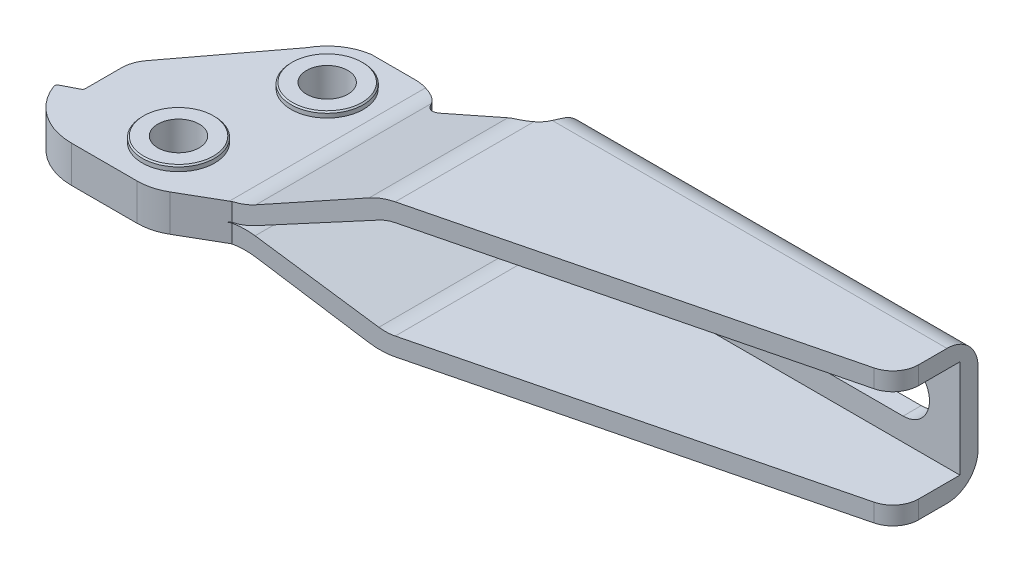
ISO-10303-21;
HEADER;
FILE_DESCRIPTION(('STEP AP214'),'2;1');
FILE_NAME('part.step','',(''),(''),'','','');
FILE_SCHEMA(('AUTOMOTIVE_DESIGN { 1 0 10303 214 1 1 1 1 }'));
ENDSEC;
DATA;
#1=APPLICATION_CONTEXT('core data for automotive mechanical design processes');
#2=APPLICATION_PROTOCOL_DEFINITION('international standard','automotive_design',2000,#1);
#3=PRODUCT_CONTEXT('',#1,'mechanical');
#4=PRODUCT('Part','Part','',(#3));
#5=PRODUCT_RELATED_PRODUCT_CATEGORY('part','',(#4));
#6=PRODUCT_DEFINITION_FORMATION('','',#4);
#7=PRODUCT_DEFINITION_CONTEXT('part definition',#1,'design');
#8=PRODUCT_DEFINITION('design','',#6,#7);
#9=PRODUCT_DEFINITION_SHAPE('','',#8);
#10=(LENGTH_UNIT() NAMED_UNIT(*) SI_UNIT(.MILLI.,.METRE.));
#11=(NAMED_UNIT(*) PLANE_ANGLE_UNIT() SI_UNIT($,.RADIAN.));
#12=(NAMED_UNIT(*) SI_UNIT($,.STERADIAN.) SOLID_ANGLE_UNIT());
#13=UNCERTAINTY_MEASURE_WITH_UNIT(LENGTH_MEASURE(1.E-05),#10,'distance_accuracy_value','');
#14=(GEOMETRIC_REPRESENTATION_CONTEXT(3) GLOBAL_UNCERTAINTY_ASSIGNED_CONTEXT((#13)) GLOBAL_UNIT_ASSIGNED_CONTEXT((#10,
#11,#12)) REPRESENTATION_CONTEXT('',''));
#15=CARTESIAN_POINT('',(0.,0.,0.));
#16=DIRECTION('',(0.,0.,1.));
#17=DIRECTION('',(1.,0.,0.));
#18=AXIS2_PLACEMENT_3D('',#15,#16,#17);
#19=CARTESIAN_POINT('',(1.02457977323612E-13,-3.55,4.02357881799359E-13));
#20=DIRECTION('',(0.,-1.,0.));
#21=DIRECTION('',(-0.723931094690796,0.,-0.689872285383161));
#22=AXIS2_PLACEMENT_3D('',#19,#20,#21);
#23=CYLINDRICAL_SURFACE('',#22,7.5);
#24=CARTESIAN_POINT('',(1.02458511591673E-13,-4.35000000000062,4.02297861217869E-13));
#25=DIRECTION('',(0.,-1.,0.));
#26=DIRECTION('',(0.,0.,1.));
#27=AXIS2_PLACEMENT_3D('',#24,#25,#26);
#28=CIRCLE('',#27,7.5);
#29=CARTESIAN_POINT('',(1.02458511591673E-13,-4.35000000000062,7.5000000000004));
#30=VERTEX_POINT('',#29);
#31=EDGE_CURVE('E832',#30,#30,#28,.F.);
#32=ORIENTED_EDGE('',*,*,#31,.T.);
#33=EDGE_LOOP('',(#32));
#34=FACE_BOUND('',#33,.T.);
#35=CARTESIAN_POINT('',(1.02458110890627E-13,-3.75,4.02342876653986E-13));
#36=DIRECTION('',(0.,-1.,0.));
#37=DIRECTION('',(-0.723931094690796,0.,-0.689872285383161));
#38=AXIS2_PLACEMENT_3D('',#35,#36,#37);
#39=CIRCLE('',#38,7.5);
#40=CARTESIAN_POINT('',(-5.42948321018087,-3.75,-5.1740421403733));
#41=VERTEX_POINT('',#40);
#42=EDGE_CURVE('E809',#41,#41,#39,.T.);
#43=ORIENTED_EDGE('',*,*,#42,.T.);
#44=EDGE_LOOP('',(#43));
#45=FACE_BOUND('',#44,.T.);
#46=ADVANCED_FACE('F14',(#34,#45),#23,.T.);
#47=CARTESIAN_POINT('',(0.,-4.55,0.));
#48=DIRECTION('',(0.,1.,0.));
#49=DIRECTION('',(0.723931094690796,0.,0.689872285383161));
#50=AXIS2_PLACEMENT_3D('',#47,#48,#49);
#51=CYLINDRICAL_SURFACE('',#50,4.);
#52=CARTESIAN_POINT('',(0.,4.6,0.));
#53=DIRECTION('',(0.,1.,0.));
#54=DIRECTION('',(-1.,0.,0.));
#55=AXIS2_PLACEMENT_3D('',#52,#53,#54);
#56=CIRCLE('',#55,4.);
#57=CARTESIAN_POINT('',(-4.,4.6,0.));
#58=VERTEX_POINT('',#57);
#59=EDGE_CURVE('E902',#58,#58,#56,.T.);
#60=ORIENTED_EDGE('',*,*,#59,.T.);
#61=EDGE_LOOP('',(#60));
#62=FACE_BOUND('',#61,.T.);
#63=CARTESIAN_POINT('',(0.,-4.6,0.));
#64=DIRECTION('',(0.,-1.,0.));
#65=DIRECTION('',(1.,0.,0.));
#66=AXIS2_PLACEMENT_3D('',#63,#64,#65);
#67=CIRCLE('',#66,4.);
#68=CARTESIAN_POINT('',(4.,-4.6,0.));
#69=VERTEX_POINT('',#68);
#70=EDGE_CURVE('E907',#69,#69,#67,.T.);
#71=ORIENTED_EDGE('',*,*,#70,.T.);
#72=EDGE_LOOP('',(#71));
#73=FACE_BOUND('',#72,.T.);
#74=ADVANCED_FACE('F852',(#62,#73),#51,.F.);
#75=CARTESIAN_POINT('',(-5.3999999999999,-3.55,23.3800000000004));
#76=DIRECTION('',(0.,-1.,0.));
#77=DIRECTION('',(-0.723931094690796,0.,-0.689872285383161));
#78=AXIS2_PLACEMENT_3D('',#75,#76,#77);
#79=CYLINDRICAL_SURFACE('',#78,7.5);
#80=CARTESIAN_POINT('',(-5.3999999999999,-4.35,23.3800000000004));
#81=DIRECTION('',(0.,-1.,0.));
#82=DIRECTION('',(1.,0.,0.));
#83=AXIS2_PLACEMENT_3D('',#80,#81,#82);
#84=CIRCLE('',#83,7.5);
#85=CARTESIAN_POINT('',(2.1000000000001,-4.35,23.3800000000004));
#86=VERTEX_POINT('',#85);
#87=EDGE_CURVE('E9',#86,#86,#84,.F.);
#88=ORIENTED_EDGE('',*,*,#87,.T.);
#89=EDGE_LOOP('',(#88));
#90=FACE_BOUND('',#89,.T.);
#91=CARTESIAN_POINT('',(-5.3999999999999,-3.75,23.3800000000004));
#92=DIRECTION('',(0.,-1.,0.));
#93=DIRECTION('',(-0.723931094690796,0.,-0.689872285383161));
#94=AXIS2_PLACEMENT_3D('',#91,#92,#93);
#95=CIRCLE('',#94,7.5);
#96=CARTESIAN_POINT('',(-10.8294832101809,-3.75,18.2059578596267));
#97=VERTEX_POINT('',#96);
#98=EDGE_CURVE('E369',#97,#97,#95,.T.);
#99=ORIENTED_EDGE('',*,*,#98,.T.);
#100=EDGE_LOOP('',(#99));
#101=FACE_BOUND('',#100,.T.);
#102=ADVANCED_FACE('F859',(#90,#101),#79,.T.);
#103=CARTESIAN_POINT('',(-5.3999999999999,-4.55,23.3800000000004));
#104=DIRECTION('',(0.,1.,0.));
#105=DIRECTION('',(0.723931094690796,0.,0.689872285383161));
#106=AXIS2_PLACEMENT_3D('',#103,#104,#105);
#107=CYLINDRICAL_SURFACE('',#106,4.);
#108=CARTESIAN_POINT('',(-5.3999999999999,4.6,23.3800000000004));
#109=DIRECTION('',(0.,1.,0.));
#110=DIRECTION('',(-1.,0.,0.));
#111=AXIS2_PLACEMENT_3D('',#108,#109,#110);
#112=CIRCLE('',#111,4.);
#113=CARTESIAN_POINT('',(-9.3999999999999,4.6,23.3800000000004));
#114=VERTEX_POINT('',#113);
#115=EDGE_CURVE('E381',#114,#114,#112,.T.);
#116=ORIENTED_EDGE('',*,*,#115,.T.);
#117=EDGE_LOOP('',(#116));
#118=FACE_BOUND('',#117,.T.);
#119=CARTESIAN_POINT('',(-5.3999999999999,-4.6,23.3800000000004));
#120=DIRECTION('',(0.,-1.,0.));
#121=DIRECTION('',(1.,0.,0.));
#122=AXIS2_PLACEMENT_3D('',#119,#120,#121);
#123=CIRCLE('',#122,4.);
#124=CARTESIAN_POINT('',(-1.3999999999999,-4.6,23.3800000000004));
#125=VERTEX_POINT('',#124);
#126=EDGE_CURVE('E904',#125,#125,#123,.T.);
#127=ORIENTED_EDGE('',*,*,#126,.T.);
#128=EDGE_LOOP('',(#127));
#129=FACE_BOUND('',#128,.T.);
#130=ADVANCED_FACE('F869',(#118,#129),#107,.F.);
#131=CARTESIAN_POINT('',(1.02457977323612E-13,-3.55,4.02357881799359E-13));
#132=DIRECTION('',(0.,-1.,0.));
#133=DIRECTION('',(-0.723931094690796,0.,-0.689872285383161));
#134=AXIS2_PLACEMENT_3D('',#131,#132,#133);
#135=CONICAL_SURFACE('',#134,7.3,0.785398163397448);
#136=ORIENTED_EDGE('',*,*,#42,.F.);
#137=EDGE_LOOP('',(#136));
#138=FACE_BOUND('',#137,.T.);
#139=CARTESIAN_POINT('',(1.02457977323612E-13,-3.55,4.03251835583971E-13));
#140=DIRECTION('',(0.,-1.,0.));
#141=DIRECTION('',(0.,0.,1.));
#142=AXIS2_PLACEMENT_3D('',#139,#140,#141);
#143=CIRCLE('',#142,7.3);
#144=CARTESIAN_POINT('',(1.02457977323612E-13,-3.55,7.3000000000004));
#145=VERTEX_POINT('',#144);
#146=EDGE_CURVE('E800',#145,#145,#143,.F.);
#147=ORIENTED_EDGE('',*,*,#146,.F.);
#148=EDGE_LOOP('',(#147));
#149=FACE_BOUND('',#148,.T.);
#150=ADVANCED_FACE('F595',(#138,#149),#135,.T.);
#151=CARTESIAN_POINT('',(-5.3999999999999,-3.55,23.3800000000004));
#152=DIRECTION('',(0.,-1.,0.));
#153=DIRECTION('',(-0.723931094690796,0.,-0.689872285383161));
#154=AXIS2_PLACEMENT_3D('',#151,#152,#153);
#155=CONICAL_SURFACE('',#154,7.3,0.785398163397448);
#156=ORIENTED_EDGE('',*,*,#98,.F.);
#157=EDGE_LOOP('',(#156));
#158=FACE_BOUND('',#157,.T.);
#159=CARTESIAN_POINT('',(-5.3999999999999,-3.55,23.3800000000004));
#160=DIRECTION('',(0.,-1.,0.));
#161=DIRECTION('',(0.,0.,1.));
#162=AXIS2_PLACEMENT_3D('',#159,#160,#161);
#163=CIRCLE('',#162,7.3);
#164=CARTESIAN_POINT('',(-5.3999999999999,-3.55,30.6800000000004));
#165=VERTEX_POINT('',#164);
#166=EDGE_CURVE('E803',#165,#165,#163,.F.);
#167=ORIENTED_EDGE('',*,*,#166,.F.);
#168=EDGE_LOOP('',(#167));
#169=FACE_BOUND('',#168,.T.);
#170=ADVANCED_FACE('F865',(#158,#169),#155,.T.);
#171=CARTESIAN_POINT('',(48.,0.,-17.49));
#172=DIRECTION('',(0.,0.,1.));
#173=DIRECTION('',(0.,1.,0.));
#174=AXIS2_PLACEMENT_3D('',#171,#172,#173);
#175=CYLINDRICAL_SURFACE('',#174,5.1);
#176=CARTESIAN_POINT('',(48.,0.,-12.99));
#177=DIRECTION('',(0.,0.,-1.));
#178=DIRECTION('',(0.,-1.,0.));
#179=AXIS2_PLACEMENT_3D('',#176,#177,#178);
#180=CIRCLE('',#179,5.1);
#181=CARTESIAN_POINT('',(48.,-5.1,-12.99));
#182=VERTEX_POINT('',#181);
#183=CARTESIAN_POINT('',(48.,5.1,-12.99));
#184=VERTEX_POINT('',#183);
#185=EDGE_CURVE('E360',#182,#184,#180,.T.);
#186=ORIENTED_EDGE('',*,*,#185,.T.);
#187=DIRECTION('',(0.,0.,1.));
#188=VECTOR('',#187,1.);
#189=CARTESIAN_POINT('',(48.,5.1,-17.49));
#190=LINE('',#189,#188);
#191=CARTESIAN_POINT('',(48.,5.1,-9.49));
#192=VERTEX_POINT('',#191);
#193=EDGE_CURVE('E387',#184,#192,#190,.T.);
#194=ORIENTED_EDGE('',*,*,#193,.T.);
#195=CARTESIAN_POINT('',(48.,0.,-9.49));
#196=DIRECTION('',(0.,0.,1.));
#197=DIRECTION('',(1.,0.,0.));
#198=AXIS2_PLACEMENT_3D('',#195,#196,#197);
#199=CIRCLE('',#198,5.1);
#200=CARTESIAN_POINT('',(48.,-5.1,-9.49));
#201=VERTEX_POINT('',#200);
#202=EDGE_CURVE('E378',#192,#201,#199,.T.);
#203=ORIENTED_EDGE('',*,*,#202,.T.);
#204=DIRECTION('',(0.,0.,1.));
#205=VECTOR('',#204,1.);
#206=CARTESIAN_POINT('',(48.,-5.1,-17.49));
#207=LINE('',#206,#205);
#208=EDGE_CURVE('E29',#182,#201,#207,.T.);
#209=ORIENTED_EDGE('',*,*,#208,.F.);
#210=EDGE_LOOP('',(#186,#194,#203,#209));
#211=FACE_BOUND('',#210,.T.);
#212=ADVANCED_FACE('F926',(#211),#175,.F.);
#213=CARTESIAN_POINT('',(102.,5.1,-17.49));
#214=DIRECTION('',(0.,1.,0.));
#215=DIRECTION('',(-1.,0.,0.));
#216=AXIS2_PLACEMENT_3D('',#213,#214,#215);
#217=PLANE('',#216);
#218=DIRECTION('',(1.,0.,0.));
#219=VECTOR('',#218,1.);
#220=CARTESIAN_POINT('',(113.,5.1,-12.99));
#221=LINE('',#220,#219);
#222=CARTESIAN_POINT('',(102.,5.1,-12.99));
#223=VERTEX_POINT('',#222);
#224=EDGE_CURVE('E391',#184,#223,#221,.T.);
#225=ORIENTED_EDGE('',*,*,#224,.T.);
#226=DIRECTION('',(0.,0.,1.));
#227=VECTOR('',#226,1.);
#228=CARTESIAN_POINT('',(102.,5.1,-17.49));
#229=LINE('',#228,#227);
#230=CARTESIAN_POINT('',(102.,5.1,-9.49));
#231=VERTEX_POINT('',#230);
#232=EDGE_CURVE('E361',#223,#231,#229,.T.);
#233=ORIENTED_EDGE('',*,*,#232,.T.);
#234=DIRECTION('',(-1.,0.,0.));
#235=VECTOR('',#234,1.);
#236=CARTESIAN_POINT('',(102.,5.1,-9.49));
#237=LINE('',#236,#235);
#238=EDGE_CURVE('E37',#231,#192,#237,.T.);
#239=ORIENTED_EDGE('',*,*,#238,.T.);
#240=ORIENTED_EDGE('',*,*,#193,.F.);
#241=EDGE_LOOP('',(#225,#233,#239,#240));
#242=FACE_BOUND('',#241,.T.);
#243=ADVANCED_FACE('F929',(#242),#217,.F.);
#244=CARTESIAN_POINT('',(102.,0.,-17.49));
#245=DIRECTION('',(0.,0.,1.));
#246=DIRECTION('',(0.,1.,0.));
#247=AXIS2_PLACEMENT_3D('',#244,#245,#246);
#248=CYLINDRICAL_SURFACE('',#247,5.1);
#249=CARTESIAN_POINT('',(102.,0.,-12.99));
#250=DIRECTION('',(0.,0.,-1.));
#251=DIRECTION('',(0.,-1.,0.));
#252=AXIS2_PLACEMENT_3D('',#249,#250,#251);
#253=CIRCLE('',#252,5.1);
#254=CARTESIAN_POINT('',(102.,-5.1,-12.99));
#255=VERTEX_POINT('',#254);
#256=EDGE_CURVE('E357',#223,#255,#253,.T.);
#257=ORIENTED_EDGE('',*,*,#256,.T.);
#258=DIRECTION('',(0.,0.,1.));
#259=VECTOR('',#258,1.);
#260=CARTESIAN_POINT('',(102.,-5.1,-17.49));
#261=LINE('',#260,#259);
#262=CARTESIAN_POINT('',(102.,-5.1,-9.49));
#263=VERTEX_POINT('',#262);
#264=EDGE_CURVE('E350',#255,#263,#261,.T.);
#265=ORIENTED_EDGE('',*,*,#264,.T.);
#266=CARTESIAN_POINT('',(102.,0.,-9.49));
#267=DIRECTION('',(0.,0.,1.));
#268=DIRECTION('',(-1.,0.,0.));
#269=AXIS2_PLACEMENT_3D('',#266,#267,#268);
#270=CIRCLE('',#269,5.1);
#271=EDGE_CURVE('E355',#263,#231,#270,.T.);
#272=ORIENTED_EDGE('',*,*,#271,.T.);
#273=ORIENTED_EDGE('',*,*,#232,.F.);
#274=EDGE_LOOP('',(#257,#265,#272,#273));
#275=FACE_BOUND('',#274,.T.);
#276=ADVANCED_FACE('F352',(#275),#248,.F.);
#277=CARTESIAN_POINT('',(48.,-5.1,-17.49));
#278=DIRECTION('',(0.,-1.,0.));
#279=DIRECTION('',(1.,0.,0.));
#280=AXIS2_PLACEMENT_3D('',#277,#278,#279);
#281=PLANE('',#280);
#282=DIRECTION('',(-1.,0.,0.));
#283=VECTOR('',#282,1.);
#284=CARTESIAN_POINT('',(113.,-5.1,-12.99));
#285=LINE('',#284,#283);
#286=EDGE_CURVE('E394',#255,#182,#285,.T.);
#287=ORIENTED_EDGE('',*,*,#286,.T.);
#288=ORIENTED_EDGE('',*,*,#208,.T.);
#289=DIRECTION('',(1.,0.,0.));
#290=VECTOR('',#289,1.);
#291=CARTESIAN_POINT('',(48.,-5.1,-9.49));
#292=LINE('',#291,#290);
#293=EDGE_CURVE('E364',#201,#263,#292,.T.);
#294=ORIENTED_EDGE('',*,*,#293,.T.);
#295=ORIENTED_EDGE('',*,*,#264,.F.);
#296=EDGE_LOOP('',(#287,#288,#294,#295));
#297=FACE_BOUND('',#296,.T.);
#298=ADVANCED_FACE('F365',(#297),#281,.F.);
#299=CARTESIAN_POINT('',(113.,6.99999999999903,-6.98999999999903));
#300=DIRECTION('',(-1.,0.,0.));
#301=DIRECTION('',(0.,-1.,0.));
#302=AXIS2_PLACEMENT_3D('',#299,#300,#301);
#303=CYLINDRICAL_SURFACE('',#302,6.00000000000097);
#304=CARTESIAN_POINT('',(37.,12.6533087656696,-9.));
#305=CARTESIAN_POINT('',(37.0000209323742,12.6911532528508,-8.89362775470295));
#306=CARTESIAN_POINT('',(36.9966059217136,12.7259583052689,-8.78615604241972));
#307=CARTESIAN_POINT('',(36.9826336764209,12.7893722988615,-8.56981211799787));
#308=CARTESIAN_POINT('',(36.972073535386,12.8179787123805,-8.46093935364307));
#309=CARTESIAN_POINT('',(36.9438561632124,12.8682839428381,-8.24509632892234));
#310=CARTESIAN_POINT('',(36.9263612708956,12.8901216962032,-8.13813732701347));
#311=CARTESIAN_POINT('',(36.8841999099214,12.9277503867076,-7.92462512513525));
#312=CARTESIAN_POINT('',(36.8595367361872,12.9435440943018,-7.81807176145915));
#313=CARTESIAN_POINT('',(36.7987696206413,12.9711725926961,-7.59013636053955));
#314=CARTESIAN_POINT('',(36.7614998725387,12.9820481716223,-7.46894730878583));
#315=CARTESIAN_POINT('',(36.677170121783,12.9965279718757,-7.22779458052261));
#316=CARTESIAN_POINT('',(36.6299889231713,13.000035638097,-7.10786742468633));
#317=CARTESIAN_POINT('',(36.5781983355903,13.,-6.99));
#318=B_SPLINE_CURVE_WITH_KNOTS('',3,(#304,#305,#306,#307,#308,#309,#310,#311,#312,#313,#314,
#315,#316,#317),.UNSPECIFIED.,.F.,.F.,(4,2,2,2,2,2,4),(0.,0.338639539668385,0.677416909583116,
1.00869227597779,1.33981561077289,1.72098798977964,2.10712517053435),.UNSPECIFIED.);
#319=CARTESIAN_POINT('',(37.,12.6533087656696,-9.));
#320=VERTEX_POINT('',#319);
#321=CARTESIAN_POINT('',(36.5781983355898,13.,-6.99));
#322=VERTEX_POINT('',#321);
#323=EDGE_CURVE('E943',#320,#322,#318,.T.);
#324=ORIENTED_EDGE('',*,*,#323,.T.);
#325=DIRECTION('',(-1.,0.,0.));
#326=VECTOR('',#325,1.);
#327=CARTESIAN_POINT('',(113.,13.,-6.99));
#328=LINE('',#327,#326);
#329=CARTESIAN_POINT('',(113.,13.,-6.99));
#330=VERTEX_POINT('',#329);
#331=EDGE_CURVE('E402',#330,#322,#328,.T.);
#332=ORIENTED_EDGE('',*,*,#331,.F.);
#333=CARTESIAN_POINT('',(113.,6.99999999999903,-6.98999999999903));
#334=DIRECTION('',(1.,0.,0.));
#335=DIRECTION('',(0.,0.,1.));
#336=AXIS2_PLACEMENT_3D('',#333,#334,#335);
#337=CIRCLE('',#336,6.00000000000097);
#338=CARTESIAN_POINT('',(113.,6.99999999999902,-12.99));
#339=VERTEX_POINT('',#338);
#340=EDGE_CURVE('E399',#339,#330,#337,.T.);
#341=ORIENTED_EDGE('',*,*,#340,.F.);
#342=DIRECTION('',(-1.,0.,0.));
#343=VECTOR('',#342,1.);
#344=CARTESIAN_POINT('',(113.,7.,-12.99));
#345=LINE('',#344,#343);
#346=CARTESIAN_POINT('',(37.,7.,-12.99));
#347=VERTEX_POINT('',#346);
#348=EDGE_CURVE('E405',#339,#347,#345,.T.);
#349=ORIENTED_EDGE('',*,*,#348,.T.);
#350=CARTESIAN_POINT('',(37.,6.99999999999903,-6.98999999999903));
#351=DIRECTION('',(-1.,0.,0.));
#352=DIRECTION('',(0.,-1.,0.));
#353=AXIS2_PLACEMENT_3D('',#350,#351,#352);
#354=CIRCLE('',#353,6.00000000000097);
#355=EDGE_CURVE('E422',#347,#320,#354,.F.);
#356=ORIENTED_EDGE('',*,*,#355,.T.);
#357=EDGE_LOOP('',(#324,#332,#341,#349,#356));
#358=FACE_BOUND('',#357,.T.);
#359=ADVANCED_FACE('F433',(#358),#303,.T.);
#360=CARTESIAN_POINT('',(113.,-6.99999999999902,-6.98999999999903));
#361=DIRECTION('',(-1.,0.,0.));
#362=DIRECTION('',(0.,-1.,0.));
#363=AXIS2_PLACEMENT_3D('',#360,#361,#362);
#364=CYLINDRICAL_SURFACE('',#363,6.00000000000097);
#365=CARTESIAN_POINT('',(36.5781983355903,-13.,-6.99));
#366=CARTESIAN_POINT('',(36.6236059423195,-13.0000199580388,-7.09337084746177));
#367=CARTESIAN_POINT('',(36.6654792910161,-12.9973291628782,-7.19831178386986));
#368=CARTESIAN_POINT('',(36.741974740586,-12.9861816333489,-7.41055144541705));
#369=CARTESIAN_POINT('',(36.7765938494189,-12.9777225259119,-7.51785112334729));
#370=CARTESIAN_POINT('',(36.8376763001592,-12.9549484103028,-7.73154619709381));
#371=CARTESIAN_POINT('',(36.8643033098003,-12.9407672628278,-7.83790897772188));
#372=CARTESIAN_POINT('',(36.9103577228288,-12.9064024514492,-8.05116665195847));
#373=CARTESIAN_POINT('',(36.9297884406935,-12.8862215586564,-8.15806127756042));
#374=CARTESIAN_POINT('',(36.9639243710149,-12.8362759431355,-8.38773589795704));
#375=CARTESIAN_POINT('',(36.9774713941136,-12.8055236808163,-8.51047480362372));
#376=CARTESIAN_POINT('',(36.9955875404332,-12.7356753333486,-8.75597181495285));
#377=CARTESIAN_POINT('',(37.0000374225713,-12.6964757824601,-8.87870934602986));
#378=CARTESIAN_POINT('',(37.,-12.6533087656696,-9.));
#379=B_SPLINE_CURVE_WITH_KNOTS('',3,(#365,#366,#367,#368,#369,#370,#371,#372,#373,#374,#375,
#376,#377,#378),.UNSPECIFIED.,.F.,.F.,(4,2,2,2,2,2,4),(0.,0.33863983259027,0.677419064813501,
1.00869421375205,1.33981659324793,1.72098839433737,2.10712519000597),.UNSPECIFIED.);
#380=CARTESIAN_POINT('',(36.5781983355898,-13.,-6.99));
#381=VERTEX_POINT('',#380);
#382=CARTESIAN_POINT('',(37.,-12.6533087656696,-9.));
#383=VERTEX_POINT('',#382);
#384=EDGE_CURVE('E414',#381,#383,#379,.T.);
#385=ORIENTED_EDGE('',*,*,#384,.T.);
#386=CARTESIAN_POINT('',(37.,-6.99999999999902,-6.98999999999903));
#387=DIRECTION('',(-1.,0.,0.));
#388=DIRECTION('',(0.,-1.,0.));
#389=AXIS2_PLACEMENT_3D('',#386,#387,#388);
#390=CIRCLE('',#389,6.00000000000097);
#391=CARTESIAN_POINT('',(37.,-7.,-12.99));
#392=VERTEX_POINT('',#391);
#393=EDGE_CURVE('E412',#383,#392,#390,.F.);
#394=ORIENTED_EDGE('',*,*,#393,.T.);
#395=DIRECTION('',(-1.,0.,0.));
#396=VECTOR('',#395,1.);
#397=CARTESIAN_POINT('',(113.,-7.,-12.99));
#398=LINE('',#397,#396);
#399=CARTESIAN_POINT('',(113.,-7.,-12.99));
#400=VERTEX_POINT('',#399);
#401=EDGE_CURVE('E407',#400,#392,#398,.T.);
#402=ORIENTED_EDGE('',*,*,#401,.F.);
#403=CARTESIAN_POINT('',(113.,-6.99999999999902,-6.98999999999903));
#404=DIRECTION('',(1.,0.,0.));
#405=DIRECTION('',(0.,0.,1.));
#406=AXIS2_PLACEMENT_3D('',#403,#404,#405);
#407=CIRCLE('',#406,6.00000000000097);
#408=CARTESIAN_POINT('',(113.,-13.,-6.99));
#409=VERTEX_POINT('',#408);
#410=EDGE_CURVE('E396',#409,#400,#407,.T.);
#411=ORIENTED_EDGE('',*,*,#410,.F.);
#412=DIRECTION('',(-1.,0.,0.));
#413=VECTOR('',#412,1.);
#414=CARTESIAN_POINT('',(113.,-13.,-6.99));
#415=LINE('',#414,#413);
#416=EDGE_CURVE('E410',#409,#381,#415,.T.);
#417=ORIENTED_EDGE('',*,*,#416,.T.);
#418=EDGE_LOOP('',(#385,#394,#402,#411,#417));
#419=FACE_BOUND('',#418,.T.);
#420=ADVANCED_FACE('F428',(#419),#364,.T.);
#421=CARTESIAN_POINT('',(35.0199999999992,3.00000000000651,-9.49));
#422=DIRECTION('',(0.,0.,1.));
#423=DIRECTION('',(0.,1.,0.));
#424=AXIS2_PLACEMENT_3D('',#421,#422,#423);
#425=PLANE('',#424);
#426=ORIENTED_EDGE('',*,*,#293,.F.);
#427=ORIENTED_EDGE('',*,*,#202,.F.);
#428=ORIENTED_EDGE('',*,*,#238,.F.);
#429=ORIENTED_EDGE('',*,*,#271,.F.);
#430=EDGE_LOOP('',(#426,#427,#428,#429));
#431=FACE_BOUND('',#430,.T.);
#432=DIRECTION('',(-1.,0.,0.));
#433=VECTOR('',#432,1.);
#434=CARTESIAN_POINT('',(115.,9.5,-9.49));
#435=LINE('',#434,#433);
#436=CARTESIAN_POINT('',(113.,9.5,-9.49));
#437=VERTEX_POINT('',#436);
#438=CARTESIAN_POINT('',(37.,9.5,-9.49));
#439=VERTEX_POINT('',#438);
#440=EDGE_CURVE('E1036',#437,#439,#435,.T.);
#441=ORIENTED_EDGE('',*,*,#440,.T.);
#442=DIRECTION('',(0.,1.,0.));
#443=VECTOR('',#442,1.);
#444=CARTESIAN_POINT('',(37.,-13.,-9.49));
#445=LINE('',#444,#443);
#446=CARTESIAN_POINT('',(37.,-9.5,-9.49));
#447=VERTEX_POINT('',#446);
#448=EDGE_CURVE('E776',#447,#439,#445,.T.);
#449=ORIENTED_EDGE('',*,*,#448,.F.);
#450=DIRECTION('',(1.,0.,0.));
#451=VECTOR('',#450,1.);
#452=CARTESIAN_POINT('',(35.02,-9.5,-9.49));
#453=LINE('',#452,#451);
#454=CARTESIAN_POINT('',(113.,-9.5,-9.49));
#455=VERTEX_POINT('',#454);
#456=EDGE_CURVE('E949',#447,#455,#453,.T.);
#457=ORIENTED_EDGE('',*,*,#456,.T.);
#458=DIRECTION('',(0.,-1.,0.));
#459=VECTOR('',#458,1.);
#460=CARTESIAN_POINT('',(113.,-13.,-9.49));
#461=LINE('',#460,#459);
#462=EDGE_CURVE('E1017',#437,#455,#461,.T.);
#463=ORIENTED_EDGE('',*,*,#462,.F.);
#464=EDGE_LOOP('',(#441,#449,#457,#463));
#465=FACE_BOUND('',#464,.T.);
#466=ADVANCED_FACE('F371',(#431,#465),#425,.T.);
#467=CARTESIAN_POINT('',(35.0199999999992,-3.00000000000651,34.4));
#468=DIRECTION('',(0.,0.,-1.));
#469=DIRECTION('',(0.,-1.,0.));
#470=AXIS2_PLACEMENT_3D('',#467,#468,#469);
#471=CYLINDRICAL_SURFACE('',#470,6.49999999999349);
#472=DIRECTION('',(0.,0.,-1.));
#473=VECTOR('',#472,1.);
#474=CARTESIAN_POINT('',(32.480273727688,-8.9832926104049,34.4));
#475=LINE('',#474,#473);
#476=CARTESIAN_POINT('',(32.480273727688,-8.9832926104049,22.482250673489));
#477=VERTEX_POINT('',#476);
#478=CARTESIAN_POINT('',(32.480273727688,-8.9832926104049,-4.02311973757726));
#479=VERTEX_POINT('',#478);
#480=EDGE_CURVE('E1052',#477,#479,#475,.T.);
#481=ORIENTED_EDGE('',*,*,#480,.F.);
#482=CARTESIAN_POINT('',(35.0199999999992,-3.00000000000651,21.8490257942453));
#483=DIRECTION('',(0.241921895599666,0.,0.970295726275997));
#484=DIRECTION('',(0.970295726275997,0.,-0.241921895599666));
#485=AXIS2_PLACEMENT_3D('',#482,#483,#484);
#486=ELLIPSE('',#485,6.69898859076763,6.49999999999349);
#487=CARTESIAN_POINT('',(35.02,-9.5,21.849025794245));
#488=VERTEX_POINT('',#487);
#489=EDGE_CURVE('E779',#488,#477,#486,.F.);
#490=ORIENTED_EDGE('',*,*,#489,.F.);
#491=DIRECTION('',(0.,0.,-1.));
#492=VECTOR('',#491,1.);
#493=CARTESIAN_POINT('',(35.02,-9.5,34.4));
#494=LINE('',#493,#492);
#495=CARTESIAN_POINT('',(35.02,-9.5,-5.01507841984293));
#496=VERTEX_POINT('',#495);
#497=EDGE_CURVE('E1046',#488,#496,#494,.T.);
#498=ORIENTED_EDGE('',*,*,#497,.T.);
#499=CARTESIAN_POINT('',(32.480273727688,-8.9832926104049,-4.02311973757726));
#500=CARTESIAN_POINT('',(32.5903757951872,-9.03005700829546,-4.0337201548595));
#501=CARTESIAN_POINT('',(32.701493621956,-9.07360759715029,-4.04815457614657));
#502=CARTESIAN_POINT('',(32.9247855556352,-9.1541914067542,-4.08497073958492));
#503=CARTESIAN_POINT('',(33.0369598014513,-9.19122375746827,-4.10735354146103));
#504=CARTESIAN_POINT('',(33.258203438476,-9.25772025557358,-4.15959784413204));
#505=CARTESIAN_POINT('',(33.367271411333,-9.28736798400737,-4.1892312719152));
#506=CARTESIAN_POINT('',(33.5844736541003,-9.34048541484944,-4.25633514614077));
#507=CARTESIAN_POINT('',(33.6926080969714,-9.36395628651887,-4.29380410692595));
#508=CARTESIAN_POINT('',(33.9060446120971,-9.40474859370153,-4.37615303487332));
#509=CARTESIAN_POINT('',(34.0113634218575,-9.42212350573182,-4.42096322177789));
#510=CARTESIAN_POINT('',(34.2193126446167,-9.45135104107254,-4.51805559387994));
#511=CARTESIAN_POINT('',(34.3219424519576,-9.46320243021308,-4.57033944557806));
#512=CARTESIAN_POINT('',(34.5265845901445,-9.4820824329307,-4.68370172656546));
#513=CARTESIAN_POINT('',(34.6284942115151,-9.48896248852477,-4.74498989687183));
#514=CARTESIAN_POINT('',(34.8278036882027,-9.49792674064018,-4.87474679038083));
#515=CARTESIAN_POINT('',(34.9252052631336,-9.50001278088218,-4.94321274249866));
#516=CARTESIAN_POINT('',(35.02,-9.5,-5.01507841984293));
#517=B_SPLINE_CURVE_WITH_KNOTS('',3,(#499,#500,#501,#502,#503,#504,#505,#506,#507,#508,#509,
#510,#511,#512,#513,#514,#515,#516),.UNSPECIFIED.,.F.,.F.,(4,2,2,2,2,2,2,2,4),(0.,
0.360193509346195,0.720435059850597,1.07054360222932,1.42058582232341,1.76747566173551,
2.1144429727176,2.47139235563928,2.8282044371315),.UNSPECIFIED.);
#518=EDGE_CURVE('E448',#479,#496,#517,.T.);
#519=ORIENTED_EDGE('',*,*,#518,.F.);
#520=EDGE_LOOP('',(#481,#490,#498,#519));
#521=FACE_BOUND('',#520,.T.);
#522=ADVANCED_FACE('F439',(#521),#471,.F.);
#523=CARTESIAN_POINT('',(13.307271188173,-0.844934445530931,34.4));
#524=DIRECTION('',(0.390727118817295,0.92050655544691,0.));
#525=DIRECTION('',(-0.92050655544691,0.390727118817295,0.));
#526=AXIS2_PLACEMENT_3D('',#523,#524,#525);
#527=PLANE('',#526);
#528=DIRECTION('',(0.92050655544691,-0.390727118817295,0.));
#529=VECTOR('',#528,1.);
#530=CARTESIAN_POINT('',(33.517998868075,-9.42377546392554,-4.));
#531=LINE('',#530,#529);
#532=CARTESIAN_POINT('',(17.954451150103,-2.81752141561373,-4.));
#533=VERTEX_POINT('',#532);
#534=CARTESIAN_POINT('',(32.,-8.77943097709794,-4.));
#535=VERTEX_POINT('',#534);
#536=EDGE_CURVE('E464',#533,#535,#531,.T.);
#537=ORIENTED_EDGE('',*,*,#536,.F.);
#538=CARTESIAN_POINT('',(17.9544511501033,-2.81752141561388,-8.99999999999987));
#539=DIRECTION('',(0.390727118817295,0.92050655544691,0.));
#540=DIRECTION('',(-0.92050655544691,0.390727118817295,0.));
#541=AXIS2_PLACEMENT_3D('',#538,#539,#540);
#542=ELLIPSE('',#541,5.43179184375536,4.99999999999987);
#543=CARTESIAN_POINT('',(13.741200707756,-1.02912436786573,-6.3076923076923));
#544=VERTEX_POINT('',#543);
#545=EDGE_CURVE('E461',#544,#533,#542,.T.);
#546=ORIENTED_EDGE('',*,*,#545,.F.);
#547=CARTESIAN_POINT('',(6.99999999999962,1.83231090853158,-1.99999999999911));
#548=DIRECTION('',(0.390727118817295,0.92050655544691,0.));
#549=DIRECTION('',(-0.92050655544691,0.390727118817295,0.));
#550=AXIS2_PLACEMENT_3D('',#547,#548,#549);
#551=ELLIPSE('',#550,8.69086695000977,8.00000000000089);
#552=CARTESIAN_POINT('',(13.307271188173,-0.84493444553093,-6.92121226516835));
#553=VERTEX_POINT('',#552);
#554=EDGE_CURVE('E456',#553,#544,#551,.F.);
#555=ORIENTED_EDGE('',*,*,#554,.F.);
#556=DIRECTION('',(0.,0.,-1.));
#557=VECTOR('',#556,1.);
#558=CARTESIAN_POINT('',(13.307271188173,-0.844934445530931,34.4));
#559=LINE('',#558,#557);
#560=CARTESIAN_POINT('',(13.307271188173,-0.84493444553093,27.2626171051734));
#561=VERTEX_POINT('',#560);
#562=EDGE_CURVE('E1055',#561,#553,#559,.T.);
#563=ORIENTED_EDGE('',*,*,#562,.F.);
#564=DIRECTION('',(-0.897180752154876,0.380826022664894,0.223692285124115));
#565=VECTOR('',#564,1.);
#566=CARTESIAN_POINT('',(14.3771690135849,-1.29907362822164,26.9958616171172));
#567=LINE('',#566,#565);
#568=EDGE_CURVE('E782',#477,#561,#567,.T.);
#569=ORIENTED_EDGE('',*,*,#568,.F.);
#570=ORIENTED_EDGE('',*,*,#480,.T.);
#571=CARTESIAN_POINT('',(32.0000000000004,-8.7794309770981,-8.99999999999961));
#572=DIRECTION('',(0.390727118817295,0.92050655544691,0.));
#573=DIRECTION('',(-0.92050655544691,0.390727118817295,0.));
#574=AXIS2_PLACEMENT_3D('',#571,#572,#573);
#575=ELLIPSE('',#574,5.43179184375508,4.99999999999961);
#576=EDGE_CURVE('E467',#535,#479,#575,.T.);
#577=ORIENTED_EDGE('',*,*,#576,.F.);
#578=EDGE_LOOP('',(#537,#546,#555,#563,#569,#570,#577));
#579=FACE_BOUND('',#578,.T.);
#580=ADVANCED_FACE('F444',(#579),#527,.T.);
#581=CARTESIAN_POINT('',(9.39999999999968,-10.0500000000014,34.4));
#582=DIRECTION('',(0.,0.,-1.));
#583=DIRECTION('',(0.,-1.,0.));
#584=AXIS2_PLACEMENT_3D('',#581,#582,#583);
#585=CYLINDRICAL_SURFACE('',#584,10.0000000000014);
#586=CARTESIAN_POINT('',(9.39999999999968,-10.0500000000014,-9.49));
#587=DIRECTION('',(0.,0.,-1.));
#588=DIRECTION('',(-1.,0.,0.));
#589=AXIS2_PLACEMENT_3D('',#586,#587,#588);
#590=CIRCLE('',#589,10.0000000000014);
#591=CARTESIAN_POINT('',(9.2585821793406,-0.051,-9.49));
#592=VERTEX_POINT('',#591);
#593=CARTESIAN_POINT('',(9.81067607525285,-0.0584363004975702,-9.49));
#594=VERTEX_POINT('',#593);
#595=EDGE_CURVE('E1029',#592,#594,#590,.T.);
#596=ORIENTED_EDGE('',*,*,#595,.F.);
#597=DIRECTION('',(0.,0.,-1.));
#598=VECTOR('',#597,1.);
#599=CARTESIAN_POINT('',(9.2585821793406,-0.0510000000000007,34.4));
#600=LINE('',#599,#598);
#601=CARTESIAN_POINT('',(9.2585821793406,-0.0510000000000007,28.4172446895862));
#602=VERTEX_POINT('',#601);
#603=EDGE_CURVE('E1058',#602,#592,#600,.T.);
#604=ORIENTED_EDGE('',*,*,#603,.F.);
#605=CARTESIAN_POINT('',(9.39999999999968,-10.0500000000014,28.3355970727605));
#606=DIRECTION('',(0.499999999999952,0.,0.866025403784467));
#607=DIRECTION('',(0.866025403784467,0.,-0.499999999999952));
#608=AXIS2_PLACEMENT_3D('',#605,#606,#607);
#609=ELLIPSE('',#608,11.5470053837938,10.0000000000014);
#610=CARTESIAN_POINT('',(9.701162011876,-0.0545359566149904,28.161721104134));
#611=VERTEX_POINT('',#610);
#612=EDGE_CURVE('E470',#611,#602,#609,.T.);
#613=ORIENTED_EDGE('',*,*,#612,.F.);
#614=CARTESIAN_POINT('',(9.39999999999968,-10.0500000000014,28.2368092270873));
#615=DIRECTION('',(0.241921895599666,0.,0.970295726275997));
#616=DIRECTION('',(0.970295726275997,0.,-0.241921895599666));
#617=AXIS2_PLACEMENT_3D('',#614,#615,#616);
#618=ELLIPSE('',#617,10.3061362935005,10.0000000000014);
#619=EDGE_CURVE('E785',#561,#611,#618,.T.);
#620=ORIENTED_EDGE('',*,*,#619,.F.);
#621=ORIENTED_EDGE('',*,*,#562,.T.);
#622=CARTESIAN_POINT('',(9.81067607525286,-0.0584363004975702,-9.49));
#623=CARTESIAN_POINT('',(10.0139986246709,-0.0667543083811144,-9.41374636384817));
#624=CARTESIAN_POINT('',(10.2138750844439,-0.0812229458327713,-9.32925602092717));
#625=CARTESIAN_POINT('',(10.6050860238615,-0.120943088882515,-9.14491994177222));
#626=CARTESIAN_POINT('',(10.7964284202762,-0.146184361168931,-9.0450888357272));
#627=CARTESIAN_POINT('',(11.1649574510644,-0.205254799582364,-8.83354067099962));
#628=CARTESIAN_POINT('',(11.3423703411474,-0.238869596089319,-8.72215571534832));
#629=CARTESIAN_POINT('',(11.686902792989,-0.313413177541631,-8.48663782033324));
#630=CARTESIAN_POINT('',(11.854021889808,-0.354342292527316,-8.36250430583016));
#631=CARTESIAN_POINT('',(12.1351223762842,-0.430516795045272,-8.13629154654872));
#632=CARTESIAN_POINT('',(12.2516175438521,-0.464470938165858,-8.03687562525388));
#633=CARTESIAN_POINT('',(12.4782946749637,-0.534844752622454,-7.83194840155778));
#634=CARTESIAN_POINT('',(12.5884778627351,-0.571263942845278,-7.72643828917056));
#635=CARTESIAN_POINT('',(12.8042507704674,-0.646576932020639,-7.50769460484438));
#636=CARTESIAN_POINT('',(12.9097231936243,-0.685503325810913,-7.3943566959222));
#637=CARTESIAN_POINT('',(13.1137420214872,-0.764522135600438,-7.16198188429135));
#638=CARTESIAN_POINT('',(13.212288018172,-0.804614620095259,-7.04294464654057));
#639=CARTESIAN_POINT('',(13.307271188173,-0.84493444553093,-6.92121226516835));
#640=B_SPLINE_CURVE_WITH_KNOTS('',3,(#622,#623,#624,#625,#626,#627,#628,#629,#630,#631,#632,
#633,#634,#635,#636,#637,#638,#639),.UNSPECIFIED.,.F.,.F.,(4,2,2,2,2,2,2,2,4),(0.,
0.651524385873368,1.30243123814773,1.93813407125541,2.57386559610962,3.04421708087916,
3.51447702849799,3.99314195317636,4.47183505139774),.UNSPECIFIED.);
#641=EDGE_CURVE('E473',#594,#553,#640,.T.);
#642=ORIENTED_EDGE('',*,*,#641,.F.);
#643=EDGE_LOOP('',(#596,#604,#613,#620,#621,#642));
#644=FACE_BOUND('',#643,.T.);
#645=ADVANCED_FACE('F487',(#644),#585,.T.);
#646=CARTESIAN_POINT('',(9.2585821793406,0.0509999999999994,34.4));
#647=DIRECTION('',(1.,0.,0.));
#648=DIRECTION('',(0.,1.,0.));
#649=AXIS2_PLACEMENT_3D('',#646,#647,#648);
#650=PLANE('',#649);
#651=ORIENTED_EDGE('',*,*,#603,.T.);
#652=DIRECTION('',(0.,-1.,0.));
#653=VECTOR('',#652,1.);
#654=CARTESIAN_POINT('',(9.2585821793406,0.051,-9.49));
#655=LINE('',#654,#653);
#656=CARTESIAN_POINT('',(9.25858217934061,0.051,-9.49));
#657=VERTEX_POINT('',#656);
#658=EDGE_CURVE('E1035',#657,#592,#655,.T.);
#659=ORIENTED_EDGE('',*,*,#658,.F.);
#660=DIRECTION('',(0.,0.,-1.));
#661=VECTOR('',#660,1.);
#662=CARTESIAN_POINT('',(9.25858217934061,0.0509999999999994,34.4));
#663=LINE('',#662,#661);
#664=CARTESIAN_POINT('',(9.25858217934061,0.0509999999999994,28.4172446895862));
#665=VERTEX_POINT('',#664);
#666=EDGE_CURVE('E1033',#665,#657,#663,.T.);
#667=ORIENTED_EDGE('',*,*,#666,.F.);
#668=DIRECTION('',(0.,1.,0.));
#669=VECTOR('',#668,1.);
#670=CARTESIAN_POINT('',(9.2585821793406,-13.,28.4172446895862));
#671=LINE('',#670,#669);
#672=EDGE_CURVE('E797',#602,#665,#671,.T.);
#673=ORIENTED_EDGE('',*,*,#672,.F.);
#674=EDGE_LOOP('',(#651,#659,#667,#673));
#675=FACE_BOUND('',#674,.T.);
#676=ADVANCED_FACE('F491',(#675),#650,.T.);
#677=CARTESIAN_POINT('',(9.3999999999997,10.0500000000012,34.4));
#678=DIRECTION('',(0.,0.,-1.));
#679=DIRECTION('',(0.,-1.,0.));
#680=AXIS2_PLACEMENT_3D('',#677,#678,#679);
#681=CYLINDRICAL_SURFACE('',#680,10.0000000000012);
#682=DIRECTION('',(0.,0.,-1.));
#683=VECTOR('',#682,1.);
#684=CARTESIAN_POINT('',(13.307271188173,0.844934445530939,34.4));
#685=LINE('',#684,#683);
#686=CARTESIAN_POINT('',(13.307271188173,0.844934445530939,27.2626171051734));
#687=VERTEX_POINT('',#686);
#688=CARTESIAN_POINT('',(13.307271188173,0.84493444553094,-6.92121226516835));
#689=VERTEX_POINT('',#688);
#690=EDGE_CURVE('E1061',#687,#689,#685,.T.);
#691=ORIENTED_EDGE('',*,*,#690,.F.);
#692=CARTESIAN_POINT('',(9.3999999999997,10.0500000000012,28.2368092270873));
#693=DIRECTION('',(0.241921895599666,0.,0.970295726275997));
#694=DIRECTION('',(0.970295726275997,0.,-0.241921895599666));
#695=AXIS2_PLACEMENT_3D('',#692,#693,#694);
#696=ELLIPSE('',#695,10.3061362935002,10.0000000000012);
#697=CARTESIAN_POINT('',(9.701162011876,0.0545359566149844,28.161721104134));
#698=VERTEX_POINT('',#697);
#699=EDGE_CURVE('E788',#698,#687,#696,.T.);
#700=ORIENTED_EDGE('',*,*,#699,.F.);
#701=CARTESIAN_POINT('',(9.3999999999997,10.0500000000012,28.3355970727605));
#702=DIRECTION('',(0.499999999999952,0.,0.866025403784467));
#703=DIRECTION('',(0.866025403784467,0.,-0.499999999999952));
#704=AXIS2_PLACEMENT_3D('',#701,#702,#703);
#705=ELLIPSE('',#704,11.5470053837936,10.0000000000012);
#706=EDGE_CURVE('E481',#665,#698,#705,.T.);
#707=ORIENTED_EDGE('',*,*,#706,.F.);
#708=ORIENTED_EDGE('',*,*,#666,.T.);
#709=CARTESIAN_POINT('',(9.3999999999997,10.0500000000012,-9.49));
#710=DIRECTION('',(0.,0.,-1.));
#711=DIRECTION('',(-1.,0.,0.));
#712=AXIS2_PLACEMENT_3D('',#709,#710,#711);
#713=CIRCLE('',#712,10.0000000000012);
#714=CARTESIAN_POINT('',(9.81067607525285,0.0584363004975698,-9.49));
#715=VERTEX_POINT('',#714);
#716=EDGE_CURVE('E1026',#715,#657,#713,.T.);
#717=ORIENTED_EDGE('',*,*,#716,.F.);
#718=CARTESIAN_POINT('',(13.307271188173,0.84493444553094,-6.92121226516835));
#719=CARTESIAN_POINT('',(13.1777600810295,0.789951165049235,-7.08719547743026));
#720=CARTESIAN_POINT('',(13.0416096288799,0.73539439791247,-7.24818672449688));
#721=CARTESIAN_POINT('',(12.7564336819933,0.628880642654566,-7.55950378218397));
#722=CARTESIAN_POINT('',(12.6073978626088,0.576925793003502,-7.70982086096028));
#723=CARTESIAN_POINT('',(12.3008641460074,0.478674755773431,-7.99529969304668));
#724=CARTESIAN_POINT('',(12.1436626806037,0.432271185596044,-8.13074235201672));
#725=CARTESIAN_POINT('',(11.8182399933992,0.345338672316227,-8.38966080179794));
#726=CARTESIAN_POINT('',(11.6500235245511,0.304807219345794,-8.5131416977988));
#727=CARTESIAN_POINT('',(11.3491369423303,0.240928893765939,-8.71630114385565));
#728=CARTESIAN_POINT('',(11.2188141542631,0.215870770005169,-8.79893435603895));
#729=CARTESIAN_POINT('',(10.9530152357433,0.170408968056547,-8.95683550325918));
#730=CARTESIAN_POINT('',(10.8175400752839,0.150004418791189,-9.03210481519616));
#731=CARTESIAN_POINT('',(10.5393770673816,0.114114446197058,-9.17619478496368));
#732=CARTESIAN_POINT('',(10.3966027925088,0.0987253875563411,-9.24487301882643));
#733=CARTESIAN_POINT('',(10.1067192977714,0.0739392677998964,-9.37384107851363));
#734=CARTESIAN_POINT('',(9.95960775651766,0.0645454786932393,-9.434126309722));
#735=CARTESIAN_POINT('',(9.81067607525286,0.0584363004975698,-9.49));
#736=B_SPLINE_CURVE_WITH_KNOTS('',3,(#718,#719,#720,#721,#722,#723,#724,#725,#726,#727,#728,
#729,#730,#731,#732,#733,#734,#735),.UNSPECIFIED.,.F.,.F.,(4,2,2,2,2,2,2,2,4),(0.,
0.652679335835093,1.30588657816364,1.94310465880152,2.58004957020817,3.04875081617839,
3.51736425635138,3.99451289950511,4.47192173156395),.UNSPECIFIED.);
#737=EDGE_CURVE('E503',#689,#715,#736,.T.);
#738=ORIENTED_EDGE('',*,*,#737,.F.);
#739=EDGE_LOOP('',(#691,#700,#707,#708,#717,#738));
#740=FACE_BOUND('',#739,.T.);
#741=ADVANCED_FACE('F495',(#740),#681,.T.);
#742=CARTESIAN_POINT('',(32.480273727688,8.9832926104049,34.4));
#743=DIRECTION('',(0.390727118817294,-0.92050655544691,0.));
#744=DIRECTION('',(0.92050655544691,0.390727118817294,0.));
#745=AXIS2_PLACEMENT_3D('',#742,#743,#744);
#746=PLANE('',#745);
#747=DIRECTION('',(0.,0.,-1.));
#748=VECTOR('',#747,1.);
#749=CARTESIAN_POINT('',(32.480273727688,8.9832926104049,34.4));
#750=LINE('',#749,#748);
#751=CARTESIAN_POINT('',(32.480273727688,8.9832926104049,22.482250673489));
#752=VERTEX_POINT('',#751);
#753=CARTESIAN_POINT('',(32.480273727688,8.9832926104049,-4.02311973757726));
#754=VERTEX_POINT('',#753);
#755=EDGE_CURVE('E1063',#752,#754,#750,.T.);
#756=ORIENTED_EDGE('',*,*,#755,.F.);
#757=DIRECTION('',(0.897180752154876,0.380826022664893,-0.223692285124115));
#758=VECTOR('',#757,1.);
#759=CARTESIAN_POINT('',(5.49375479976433,-2.47166631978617,29.2107455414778));
#760=LINE('',#759,#758);
#761=EDGE_CURVE('E791',#687,#752,#760,.T.);
#762=ORIENTED_EDGE('',*,*,#761,.F.);
#763=ORIENTED_EDGE('',*,*,#690,.T.);
#764=CARTESIAN_POINT('',(6.99999999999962,-1.83231090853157,-1.99999999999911));
#765=DIRECTION('',(0.390727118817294,-0.92050655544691,0.));
#766=DIRECTION('',(0.92050655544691,0.390727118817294,0.));
#767=AXIS2_PLACEMENT_3D('',#764,#765,#766);
#768=ELLIPSE('',#767,8.69086695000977,8.00000000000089);
#769=CARTESIAN_POINT('',(13.741200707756,1.02912436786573,-6.3076923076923));
#770=VERTEX_POINT('',#769);
#771=EDGE_CURVE('E510',#770,#689,#768,.F.);
#772=ORIENTED_EDGE('',*,*,#771,.F.);
#773=CARTESIAN_POINT('',(17.9544511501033,2.81752141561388,-8.99999999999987));
#774=DIRECTION('',(0.390727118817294,-0.92050655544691,0.));
#775=DIRECTION('',(0.92050655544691,0.390727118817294,0.));
#776=AXIS2_PLACEMENT_3D('',#773,#774,#775);
#777=ELLIPSE('',#776,5.43179184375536,4.99999999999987);
#778=CARTESIAN_POINT('',(17.954451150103,2.81752141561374,-4.));
#779=VERTEX_POINT('',#778);
#780=EDGE_CURVE('E513',#779,#770,#777,.T.);
#781=ORIENTED_EDGE('',*,*,#780,.F.);
#782=DIRECTION('',(-0.92050655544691,-0.390727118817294,0.));
#783=VECTOR('',#782,1.);
#784=CARTESIAN_POINT('',(24.1666601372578,5.45441574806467,-4.));
#785=LINE('',#784,#783);
#786=CARTESIAN_POINT('',(32.,8.77943097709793,-4.));
#787=VERTEX_POINT('',#786);
#788=EDGE_CURVE('E516',#787,#779,#785,.T.);
#789=ORIENTED_EDGE('',*,*,#788,.F.);
#790=CARTESIAN_POINT('',(32.0000000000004,8.7794309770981,-8.99999999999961));
#791=DIRECTION('',(0.390727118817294,-0.92050655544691,0.));
#792=DIRECTION('',(0.92050655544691,0.390727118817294,0.));
#793=AXIS2_PLACEMENT_3D('',#790,#791,#792);
#794=ELLIPSE('',#793,5.43179184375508,4.99999999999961);
#795=EDGE_CURVE('E519',#754,#787,#794,.T.);
#796=ORIENTED_EDGE('',*,*,#795,.F.);
#797=EDGE_LOOP('',(#756,#762,#763,#772,#781,#789,#796));
#798=FACE_BOUND('',#797,.T.);
#799=ADVANCED_FACE('F500',(#798),#746,.T.);
#800=CARTESIAN_POINT('',(35.0199999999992,3.00000000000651,34.4));
#801=DIRECTION('',(0.,0.,-1.));
#802=DIRECTION('',(0.,-1.,0.));
#803=AXIS2_PLACEMENT_3D('',#800,#801,#802);
#804=CYLINDRICAL_SURFACE('',#803,6.49999999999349);
#805=DIRECTION('',(0.,0.,-1.));
#806=VECTOR('',#805,1.);
#807=CARTESIAN_POINT('',(35.02,9.5,34.4));
#808=LINE('',#807,#806);
#809=CARTESIAN_POINT('',(35.02,9.5,21.849025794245));
#810=VERTEX_POINT('',#809);
#811=CARTESIAN_POINT('',(35.02,9.5,-5.01507841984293));
#812=VERTEX_POINT('',#811);
#813=EDGE_CURVE('E1066',#810,#812,#808,.T.);
#814=ORIENTED_EDGE('',*,*,#813,.F.);
#815=CARTESIAN_POINT('',(35.0199999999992,3.00000000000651,21.8490257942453));
#816=DIRECTION('',(0.241921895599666,0.,0.970295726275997));
#817=DIRECTION('',(0.970295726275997,0.,-0.241921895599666));
#818=AXIS2_PLACEMENT_3D('',#815,#816,#817);
#819=ELLIPSE('',#818,6.69898859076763,6.49999999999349);
#820=EDGE_CURVE('E794',#752,#810,#819,.F.);
#821=ORIENTED_EDGE('',*,*,#820,.F.);
#822=ORIENTED_EDGE('',*,*,#755,.T.);
#823=CARTESIAN_POINT('',(35.02,9.5,-5.01507841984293));
#824=CARTESIAN_POINT('',(34.9242305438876,9.50001338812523,-4.94247291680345));
#825=CARTESIAN_POINT('',(34.8257993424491,9.49788390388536,-4.8733378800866));
#826=CARTESIAN_POINT('',(34.6243433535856,9.48872721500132,-4.74239443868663));
#827=CARTESIAN_POINT('',(34.5213167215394,9.4816980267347,-4.68058901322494));
#828=CARTESIAN_POINT('',(34.3144418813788,9.46240530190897,-4.56638582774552));
#829=CARTESIAN_POINT('',(34.2106990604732,9.45029520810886,-4.51377166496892));
#830=CARTESIAN_POINT('',(34.000497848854,9.420426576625,-4.41617758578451));
#831=CARTESIAN_POINT('',(33.8940401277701,9.40266941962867,-4.37119580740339));
#832=CARTESIAN_POINT('',(33.6804546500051,9.36139284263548,-4.28947934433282));
#833=CARTESIAN_POINT('',(33.5733465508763,9.33793773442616,-4.25266082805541));
#834=CARTESIAN_POINT('',(33.3582456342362,9.28497004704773,-4.18670283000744));
#835=CARTESIAN_POINT('',(33.2502526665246,9.25545641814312,-4.15756468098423));
#836=CARTESIAN_POINT('',(33.0312393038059,9.18936686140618,-4.10617301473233));
#837=CARTESIAN_POINT('',(32.92022085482,9.15261275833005,-4.08414076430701));
#838=CARTESIAN_POINT('',(32.6992280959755,9.07271866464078,-4.04786120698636));
#839=CARTESIAN_POINT('',(32.5892536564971,9.02957947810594,-4.03361292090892));
#840=CARTESIAN_POINT('',(32.480273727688,8.9832926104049,-4.02311973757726));
#841=B_SPLINE_CURVE_WITH_KNOTS('',3,(#823,#824,#825,#826,#827,#828,#829,#830,#831,#832,#833,
#834,#835,#836,#837,#838,#839,#840),.UNSPECIFIED.,.F.,.F.,(4,2,2,2,2,2,2,2,4),(0.,
0.360481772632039,0.72110956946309,1.07155202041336,1.42190885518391,1.76848137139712,
2.11511398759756,2.47168187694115,2.82820490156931),.UNSPECIFIED.);
#842=EDGE_CURVE('E522',#812,#754,#841,.T.);
#843=ORIENTED_EDGE('',*,*,#842,.F.);
#844=EDGE_LOOP('',(#814,#821,#822,#843));
#845=FACE_BOUND('',#844,.T.);
#846=ADVANCED_FACE('F531',(#845),#804,.F.);
#847=CARTESIAN_POINT('',(115.,9.5,34.4));
#848=DIRECTION('',(0.,-1.,0.));
#849=DIRECTION('',(1.,0.,0.));
#850=AXIS2_PLACEMENT_3D('',#847,#848,#849);
#851=PLANE('',#850);
#852=DIRECTION('',(0.,0.,1.));
#853=VECTOR('',#852,1.);
#854=CARTESIAN_POINT('',(37.,9.5,-12.99));
#855=LINE('',#854,#853);
#856=CARTESIAN_POINT('',(37.,9.5,-9.));
#857=VERTEX_POINT('',#856);
#858=EDGE_CURVE('E998',#439,#857,#855,.T.);
#859=ORIENTED_EDGE('',*,*,#858,.F.);
#860=ORIENTED_EDGE('',*,*,#440,.F.);
#861=DIRECTION('',(0.,0.,-1.));
#862=VECTOR('',#861,1.);
#863=CARTESIAN_POINT('',(113.,9.5,-1.5));
#864=LINE('',#863,#862);
#865=CARTESIAN_POINT('',(113.,9.5,-1.5));
#866=VERTEX_POINT('',#865);
#867=EDGE_CURVE('E1068',#866,#437,#864,.T.);
#868=ORIENTED_EDGE('',*,*,#867,.F.);
#869=CARTESIAN_POINT('',(107.999999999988,9.5,-1.50000000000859));
#870=DIRECTION('',(0.,-1.,0.));
#871=DIRECTION('',(1.,0.,0.));
#872=AXIS2_PLACEMENT_3D('',#869,#870,#871);
#873=CIRCLE('',#872,5.00000000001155);
#874=CARTESIAN_POINT('',(109.209609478,9.5,3.35147863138));
#875=VERTEX_POINT('',#874);
#876=EDGE_CURVE('E770',#875,#866,#873,.F.);
#877=ORIENTED_EDGE('',*,*,#876,.F.);
#878=DIRECTION('',(0.970295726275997,0.,-0.241921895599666));
#879=VECTOR('',#878,1.);
#880=CARTESIAN_POINT('',(9.701162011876,9.5,28.161721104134));
#881=LINE('',#880,#879);
#882=EDGE_CURVE('E980',#810,#875,#881,.T.);
#883=ORIENTED_EDGE('',*,*,#882,.F.);
#884=ORIENTED_EDGE('',*,*,#813,.T.);
#885=CARTESIAN_POINT('',(32.0000000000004,9.5,-8.99999999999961));
#886=DIRECTION('',(0.,-1.,0.));
#887=DIRECTION('',(1.,0.,0.));
#888=AXIS2_PLACEMENT_3D('',#885,#886,#887);
#889=CIRCLE('',#888,4.99999999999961);
#890=EDGE_CURVE('E1000',#857,#812,#889,.T.);
#891=ORIENTED_EDGE('',*,*,#890,.F.);
#892=EDGE_LOOP('',(#859,#860,#868,#877,#883,#884,#891));
#893=FACE_BOUND('',#892,.T.);
#894=ADVANCED_FACE('F535',(#893),#851,.T.);
#895=CARTESIAN_POINT('',(35.02,-9.5,34.4));
#896=DIRECTION('',(0.,1.,0.));
#897=DIRECTION('',(-1.,0.,0.));
#898=AXIS2_PLACEMENT_3D('',#895,#896,#897);
#899=PLANE('',#898);
#900=ORIENTED_EDGE('',*,*,#497,.F.);
#901=DIRECTION('',(-0.970295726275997,0.,0.241921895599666));
#902=VECTOR('',#901,1.);
#903=CARTESIAN_POINT('',(9.701162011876,-9.5,28.161721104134));
#904=LINE('',#903,#902);
#905=CARTESIAN_POINT('',(109.209609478,-9.5,3.35147863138));
#906=VERTEX_POINT('',#905);
#907=EDGE_CURVE('E1005',#906,#488,#904,.T.);
#908=ORIENTED_EDGE('',*,*,#907,.F.);
#909=CARTESIAN_POINT('',(107.999999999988,-9.5,-1.50000000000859));
#910=DIRECTION('',(0.,1.,0.));
#911=DIRECTION('',(-1.,0.,0.));
#912=AXIS2_PLACEMENT_3D('',#909,#910,#911);
#913=CIRCLE('',#912,5.00000000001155);
#914=CARTESIAN_POINT('',(113.,-9.5,-1.5));
#915=VERTEX_POINT('',#914);
#916=EDGE_CURVE('E773',#915,#906,#913,.F.);
#917=ORIENTED_EDGE('',*,*,#916,.F.);
#918=DIRECTION('',(0.,0.,1.));
#919=VECTOR('',#918,1.);
#920=CARTESIAN_POINT('',(113.,-9.5,-1.5));
#921=LINE('',#920,#919);
#922=EDGE_CURVE('E1002',#455,#915,#921,.T.);
#923=ORIENTED_EDGE('',*,*,#922,.F.);
#924=ORIENTED_EDGE('',*,*,#456,.F.);
#925=DIRECTION('',(0.,0.,-1.));
#926=VECTOR('',#925,1.);
#927=CARTESIAN_POINT('',(37.,-9.5,-12.99));
#928=LINE('',#927,#926);
#929=CARTESIAN_POINT('',(37.,-9.5,-9.));
#930=VERTEX_POINT('',#929);
#931=EDGE_CURVE('E1012',#930,#447,#928,.T.);
#932=ORIENTED_EDGE('',*,*,#931,.F.);
#933=CARTESIAN_POINT('',(32.0000000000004,-9.5,-8.99999999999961));
#934=DIRECTION('',(0.,1.,0.));
#935=DIRECTION('',(-1.,0.,0.));
#936=AXIS2_PLACEMENT_3D('',#933,#934,#935);
#937=CIRCLE('',#936,4.99999999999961);
#938=EDGE_CURVE('E1015',#496,#930,#937,.T.);
#939=ORIENTED_EDGE('',*,*,#938,.F.);
#940=EDGE_LOOP('',(#900,#908,#917,#923,#924,#932,#939));
#941=FACE_BOUND('',#940,.T.);
#942=ADVANCED_FACE('F539',(#941),#899,.T.);
#943=ORIENTED_EDGE('',*,*,#716,.T.);
#944=ORIENTED_EDGE('',*,*,#658,.T.);
#945=ORIENTED_EDGE('',*,*,#595,.T.);
#946=DIRECTION('',(0.,1.,0.));
#947=VECTOR('',#946,1.);
#948=CARTESIAN_POINT('',(9.81067607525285,-13.,-9.49));
#949=LINE('',#948,#947);
#950=EDGE_CURVE('E457',#715,#594,#949,.F.);
#951=ORIENTED_EDGE('',*,*,#950,.F.);
#952=EDGE_LOOP('',(#943,#944,#945,#951));
#953=FACE_BOUND('',#952,.T.);
#954=ADVANCED_FACE('F440',(#953),#425,.T.);
#955=CARTESIAN_POINT('',(35.0199999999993,3.00000000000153,35.89));
#956=DIRECTION('',(0.,0.,-1.));
#957=DIRECTION('',(0.,-1.,0.));
#958=AXIS2_PLACEMENT_3D('',#955,#956,#957);
#959=CYLINDRICAL_SURFACE('',#958,9.99999999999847);
#960=CARTESIAN_POINT('',(35.0199999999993,3.00000000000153,-4.));
#961=DIRECTION('',(0.,0.,-1.));
#962=DIRECTION('',(0.,-1.,0.));
#963=AXIS2_PLACEMENT_3D('',#960,#961,#962);
#964=CIRCLE('',#963,9.99999999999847);
#965=CARTESIAN_POINT('',(30.980566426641,12.147839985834,-4.));
#966=VERTEX_POINT('',#965);
#967=CARTESIAN_POINT('',(32.,12.5330792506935,-4.));
#968=VERTEX_POINT('',#967);
#969=EDGE_CURVE('E561',#966,#968,#964,.T.);
#970=ORIENTED_EDGE('',*,*,#969,.F.);
#971=DIRECTION('',(0.,0.,-1.));
#972=VECTOR('',#971,1.);
#973=CARTESIAN_POINT('',(30.980566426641,12.147839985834,35.89));
#974=LINE('',#973,#972);
#975=CARTESIAN_POINT('',(30.980566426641,12.147839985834,22.8561696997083));
#976=VERTEX_POINT('',#975);
#977=EDGE_CURVE('E972',#976,#966,#974,.T.);
#978=ORIENTED_EDGE('',*,*,#977,.F.);
#979=CARTESIAN_POINT('',(35.0199999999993,3.00000000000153,21.8490257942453));
#980=DIRECTION('',(0.241921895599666,0.,0.970295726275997));
#981=DIRECTION('',(0.970295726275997,0.,-0.241921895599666));
#982=AXIS2_PLACEMENT_3D('',#979,#980,#981);
#983=ELLIPSE('',#982,10.3061362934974,9.99999999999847);
#984=CARTESIAN_POINT('',(35.0199999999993,13.,21.8490257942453));
#985=VERTEX_POINT('',#984);
#986=EDGE_CURVE('E962',#985,#976,#983,.T.);
#987=ORIENTED_EDGE('',*,*,#986,.F.);
#988=DIRECTION('',(0.,0.,-1.));
#989=VECTOR('',#988,1.);
#990=CARTESIAN_POINT('',(35.02,13.,35.89));
#991=LINE('',#990,#989);
#992=CARTESIAN_POINT('',(35.02,13.,-5.01507841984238));
#993=VERTEX_POINT('',#992);
#994=EDGE_CURVE('E529',#985,#993,#991,.T.);
#995=ORIENTED_EDGE('',*,*,#994,.T.);
#996=CARTESIAN_POINT('',(32.,12.5330792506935,-4.));
#997=CARTESIAN_POINT('',(32.1255935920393,12.5728903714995,-3.99997936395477));
#998=CARTESIAN_POINT('',(32.2520071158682,12.6101825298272,-4.00473177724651));
#999=CARTESIAN_POINT('',(32.505522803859,12.6795948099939,-4.02400208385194));
#1000=CARTESIAN_POINT('',(32.6326250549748,12.7117142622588,-4.0385212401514));
#1001=CARTESIAN_POINT('',(32.8828019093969,12.7697705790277,-4.07697094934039));
#1002=CARTESIAN_POINT('',(33.0058850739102,12.7958614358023,-4.10061228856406));
#1003=CARTESIAN_POINT('',(33.2508105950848,12.8430440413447,-4.15734867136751));
#1004=CARTESIAN_POINT('',(33.3726530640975,12.8641362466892,-4.19044285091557));
#1005=CARTESIAN_POINT('',(33.6273661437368,12.9034810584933,-4.27016121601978));
#1006=CARTESIAN_POINT('',(33.7599862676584,12.9211711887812,-4.31786898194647));
#1007=CARTESIAN_POINT('',(34.0212897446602,12.9508736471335,-4.42459615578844));
#1008=CARTESIAN_POINT('',(34.1499718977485,12.962884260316,-4.48361897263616));
#1009=CARTESIAN_POINT('',(34.4063951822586,12.9820110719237,-4.61472161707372));
#1010=CARTESIAN_POINT('',(34.5339591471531,12.9889490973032,-4.68717378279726));
#1011=CARTESIAN_POINT('',(34.7823313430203,12.9979527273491,-4.84305317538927));
#1012=CARTESIAN_POINT('',(34.9031414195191,13.0000196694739,-4.92647738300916));
#1013=CARTESIAN_POINT('',(35.02,13.,-5.01507841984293));
#1014=B_SPLINE_CURVE_WITH_KNOTS('',3,(#996,#997,#998,#999,#1000,#1001,#1002,#1003,#1004,#1005,
#1006,#1007,#1008,#1009,#1010,#1011,#1012,#1013),.UNSPECIFIED.,.F.,.F.,(4,2,2,2,2,2,2,2,4),(0.,
0.395175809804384,0.79040273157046,1.1740111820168,1.55758458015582,1.98308925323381,
2.40872232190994,2.84866869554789,3.28849425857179),.UNSPECIFIED.);
#1015=EDGE_CURVE('E552',#968,#993,#1014,.T.);
#1016=ORIENTED_EDGE('',*,*,#1015,.F.);
#1017=EDGE_LOOP('',(#970,#978,#987,#995,#1016));
#1018=FACE_BOUND('',#1017,.T.);
#1019=ADVANCED_FACE('F544',(#1018),#959,.T.);
#1020=CARTESIAN_POINT('',(13.439433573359,4.4021600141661,35.89));
#1021=DIRECTION('',(-0.40394335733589,0.914783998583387,0.));
#1022=DIRECTION('',(-0.914783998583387,-0.40394335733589,0.));
#1023=AXIS2_PLACEMENT_3D('',#1020,#1021,#1022);
#1024=PLANE('',#1023);
#1025=CARTESIAN_POINT('',(17.9544511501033,6.39586712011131,-8.99999999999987));
#1026=DIRECTION('',(-0.40394335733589,0.914783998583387,0.));
#1027=DIRECTION('',(0.914783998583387,0.40394335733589,0.));
#1028=AXIS2_PLACEMENT_3D('',#1025,#1026,#1027);
#1029=ELLIPSE('',#1028,5.4657711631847,4.99999999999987);
#1030=CARTESIAN_POINT('',(13.741200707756,4.53541204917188,-6.3076923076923));
#1031=VERTEX_POINT('',#1030);
#1032=CARTESIAN_POINT('',(17.954451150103,6.39586712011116,-4.));
#1033=VERTEX_POINT('',#1032);
#1034=EDGE_CURVE('E565',#1031,#1033,#1029,.T.);
#1035=ORIENTED_EDGE('',*,*,#1034,.F.);
#1036=CARTESIAN_POINT('',(6.99999999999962,1.55868393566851,-1.99999999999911));
#1037=DIRECTION('',(-0.40394335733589,0.914783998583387,0.));
#1038=DIRECTION('',(0.914783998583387,0.40394335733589,0.));
#1039=AXIS2_PLACEMENT_3D('',#1036,#1037,#1038);
#1040=ELLIPSE('',#1039,8.74523386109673,8.00000000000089);
#1041=CARTESIAN_POINT('',(13.439433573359,4.4021600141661,-6.74696695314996));
#1042=VERTEX_POINT('',#1041);
#1043=EDGE_CURVE('E560',#1042,#1031,#1040,.F.);
#1044=ORIENTED_EDGE('',*,*,#1043,.F.);
#1045=DIRECTION('',(0.,0.,-1.));
#1046=VECTOR('',#1045,1.);
#1047=CARTESIAN_POINT('',(13.439433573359,4.4021600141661,35.89));
#1048=LINE('',#1047,#1046);
#1049=CARTESIAN_POINT('',(13.439433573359,4.40216001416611,27.229665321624));
#1050=VERTEX_POINT('',#1049);
#1051=EDGE_CURVE('E968',#1050,#1042,#1048,.T.);
#1052=ORIENTED_EDGE('',*,*,#1051,.F.);
#1053=DIRECTION('',(-0.891879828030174,-0.393829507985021,0.22237061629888));
#1054=VECTOR('',#1053,1.);
#1055=CARTESIAN_POINT('',(4.16848998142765,0.308367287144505,29.541171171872));
#1056=LINE('',#1055,#1054);
#1057=EDGE_CURVE('E761',#976,#1050,#1056,.T.);
#1058=ORIENTED_EDGE('',*,*,#1057,.F.);
#1059=ORIENTED_EDGE('',*,*,#977,.T.);
#1060=DIRECTION('',(0.914783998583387,0.40394335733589,0.));
#1061=VECTOR('',#1060,1.);
#1062=CARTESIAN_POINT('',(22.5410058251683,8.42116303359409,-4.));
#1063=LINE('',#1062,#1061);
#1064=EDGE_CURVE('E568',#1033,#966,#1063,.T.);
#1065=ORIENTED_EDGE('',*,*,#1064,.F.);
#1066=EDGE_LOOP('',(#1035,#1044,#1052,#1058,#1059,#1065));
#1067=FACE_BOUND('',#1066,.T.);
#1068=ADVANCED_FACE('F548',(#1067),#1024,.T.);
#1069=CARTESIAN_POINT('',(9.40000000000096,13.5499999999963,35.89));
#1070=DIRECTION('',(0.,0.,-1.));
#1071=DIRECTION('',(0.,-1.,0.));
#1072=AXIS2_PLACEMENT_3D('',#1069,#1070,#1071);
#1073=CYLINDRICAL_SURFACE('',#1072,9.99999999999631);
#1074=DIRECTION('',(0.,0.,-1.));
#1075=VECTOR('',#1074,1.);
#1076=CARTESIAN_POINT('',(9.4,3.55,35.89));
#1077=LINE('',#1076,#1075);
#1078=CARTESIAN_POINT('',(9.4,3.55,28.3355970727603));
#1079=VERTEX_POINT('',#1078);
#1080=CARTESIAN_POINT('',(9.4,3.55,-9.63151361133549));
#1081=VERTEX_POINT('',#1080);
#1082=EDGE_CURVE('E964',#1079,#1081,#1077,.T.);
#1083=ORIENTED_EDGE('',*,*,#1082,.F.);
#1084=CARTESIAN_POINT('',(9.40000000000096,13.5499999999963,28.3355970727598));
#1085=DIRECTION('',(0.499999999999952,0.,0.866025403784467));
#1086=DIRECTION('',(0.866025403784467,0.,-0.499999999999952));
#1087=AXIS2_PLACEMENT_3D('',#1084,#1085,#1086);
#1088=ELLIPSE('',#1087,11.5470053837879,9.99999999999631);
#1089=CARTESIAN_POINT('',(9.701162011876,3.55453595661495,28.161721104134));
#1090=VERTEX_POINT('',#1089);
#1091=EDGE_CURVE('E571',#1090,#1079,#1088,.F.);
#1092=ORIENTED_EDGE('',*,*,#1091,.F.);
#1093=CARTESIAN_POINT('',(9.40000000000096,13.5499999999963,28.2368092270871));
#1094=DIRECTION('',(0.241921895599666,0.,0.970295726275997));
#1095=DIRECTION('',(0.970295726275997,0.,-0.241921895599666));
#1096=AXIS2_PLACEMENT_3D('',#1093,#1094,#1095);
#1097=ELLIPSE('',#1096,10.3061362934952,9.99999999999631);
#1098=EDGE_CURVE('E764',#1050,#1090,#1097,.F.);
#1099=ORIENTED_EDGE('',*,*,#1098,.F.);
#1100=ORIENTED_EDGE('',*,*,#1051,.T.);
#1101=CARTESIAN_POINT('',(9.4,3.55,-9.63151361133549));
#1102=CARTESIAN_POINT('',(9.6007340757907,3.54995807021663,-9.56843298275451));
#1103=CARTESIAN_POINT('',(9.79887516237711,3.55604183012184,-9.4973736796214));
#1104=CARTESIAN_POINT('',(10.1882123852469,3.57921865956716,-9.34024011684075));
#1105=CARTESIAN_POINT('',(10.3794157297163,3.59629993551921,-9.25418201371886));
#1106=CARTESIAN_POINT('',(10.7485557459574,3.63964785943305,-9.07034416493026));
#1107=CARTESIAN_POINT('',(10.9267104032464,3.66565684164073,-8.9729391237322));
#1108=CARTESIAN_POINT('',(11.2741595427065,3.72561200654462,-8.76553721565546));
#1109=CARTESIAN_POINT('',(11.4434521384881,3.75955987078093,-8.65553768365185));
#1110=CARTESIAN_POINT('',(11.7824588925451,3.83630157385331,-8.41667410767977));
#1111=CARTESIAN_POINT('',(11.9515524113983,3.87951246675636,-8.28706431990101));
#1112=CARTESIAN_POINT('',(12.2780044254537,3.97159373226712,-8.015625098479));
#1113=CARTESIAN_POINT('',(12.4353606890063,4.02046517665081,-7.8737933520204));
#1114=CARTESIAN_POINT('',(12.7421855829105,4.12361424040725,-7.5744597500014));
#1115=CARTESIAN_POINT('',(12.8912830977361,4.1780090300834,-7.41661842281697));
#1116=CARTESIAN_POINT('',(13.1757544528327,4.28895135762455,-7.08988455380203));
#1117=CARTESIAN_POINT('',(13.3111359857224,4.34549766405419,-6.92099829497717));
#1118=CARTESIAN_POINT('',(13.439433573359,4.4021600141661,-6.74696695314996));
#1119=B_SPLINE_CURVE_WITH_KNOTS('',3,(#1101,#1102,#1103,#1104,#1105,#1106,#1107,#1108,#1109,
#1110,#1111,#1112,#1113,#1114,#1115,#1116,#1117,#1118),.UNSPECIFIED.,.F.,.F.,(4,2,2,2,2,2,2,2,
4),(0.,0.630865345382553,1.26105528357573,1.87440421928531,2.48788318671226,3.13927883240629,
3.79079801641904,4.46159354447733,5.13201074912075),.UNSPECIFIED.);
#1120=EDGE_CURVE('E574',#1081,#1042,#1119,.T.);
#1121=ORIENTED_EDGE('',*,*,#1120,.F.);
#1122=EDGE_LOOP('',(#1083,#1092,#1099,#1100,#1121));
#1123=FACE_BOUND('',#1122,.T.);
#1124=ADVANCED_FACE('F583',(#1123),#1073,.F.);
#1125=CARTESIAN_POINT('',(9.40000000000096,-13.5499999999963,35.89));
#1126=DIRECTION('',(0.,0.,-1.));
#1127=DIRECTION('',(0.,-1.,0.));
#1128=AXIS2_PLACEMENT_3D('',#1125,#1126,#1127);
#1129=CYLINDRICAL_SURFACE('',#1128,9.99999999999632);
#1130=DIRECTION('',(0.,0.,-1.));
#1131=VECTOR('',#1130,1.);
#1132=CARTESIAN_POINT('',(13.439433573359,-4.4021600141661,35.89));
#1133=LINE('',#1132,#1131);
#1134=CARTESIAN_POINT('',(13.439433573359,-4.4021600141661,27.229665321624));
#1135=VERTEX_POINT('',#1134);
#1136=CARTESIAN_POINT('',(13.439433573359,-4.4021600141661,-6.74696695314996));
#1137=VERTEX_POINT('',#1136);
#1138=EDGE_CURVE('E1192',#1135,#1137,#1133,.T.);
#1139=ORIENTED_EDGE('',*,*,#1138,.F.);
#1140=CARTESIAN_POINT('',(9.40000000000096,-13.5499999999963,28.2368092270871));
#1141=DIRECTION('',(0.241921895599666,0.,0.970295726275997));
#1142=DIRECTION('',(0.970295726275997,0.,-0.241921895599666));
#1143=AXIS2_PLACEMENT_3D('',#1140,#1141,#1142);
#1144=ELLIPSE('',#1143,10.3061362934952,9.99999999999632);
#1145=CARTESIAN_POINT('',(9.701162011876,-3.55453595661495,28.161721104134));
#1146=VERTEX_POINT('',#1145);
#1147=EDGE_CURVE('E752',#1146,#1135,#1144,.F.);
#1148=ORIENTED_EDGE('',*,*,#1147,.F.);
#1149=CARTESIAN_POINT('',(9.40000000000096,-13.5499999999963,28.3355970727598));
#1150=DIRECTION('',(0.499999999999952,0.,0.866025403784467));
#1151=DIRECTION('',(0.866025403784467,0.,-0.499999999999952));
#1152=AXIS2_PLACEMENT_3D('',#1149,#1150,#1151);
#1153=ELLIPSE('',#1152,11.5470053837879,9.99999999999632);
#1154=CARTESIAN_POINT('',(9.4,-3.55,28.3355970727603));
#1155=VERTEX_POINT('',#1154);
#1156=EDGE_CURVE('E616',#1155,#1146,#1153,.F.);
#1157=ORIENTED_EDGE('',*,*,#1156,.F.);
#1158=DIRECTION('',(0.,0.,-1.));
#1159=VECTOR('',#1158,1.);
#1160=CARTESIAN_POINT('',(9.4,-3.55,35.89));
#1161=LINE('',#1160,#1159);
#1162=CARTESIAN_POINT('',(9.4,-3.55,-9.63151361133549));
#1163=VERTEX_POINT('',#1162);
#1164=EDGE_CURVE('E1189',#1155,#1163,#1161,.T.);
#1165=ORIENTED_EDGE('',*,*,#1164,.T.);
#1166=CARTESIAN_POINT('',(13.439433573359,-4.4021600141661,-6.74696695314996));
#1167=CARTESIAN_POINT('',(13.3114452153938,-4.34563431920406,-6.92057885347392));
#1168=CARTESIAN_POINT('',(13.1764071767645,-4.28922406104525,-7.08907023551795));
#1169=CARTESIAN_POINT('',(12.8926888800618,-4.17853929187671,-7.4150680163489));
#1170=CARTESIAN_POINT('',(12.7440011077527,-4.12426598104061,-7.57256827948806));
#1171=CARTESIAN_POINT('',(12.4380320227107,-4.02132359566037,-7.87130232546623));
#1172=CARTESIAN_POINT('',(12.2811191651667,-3.97253847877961,-8.01287294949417));
#1173=CARTESIAN_POINT('',(11.9556032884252,-3.8805903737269,-8.28385480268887));
#1174=CARTESIAN_POINT('',(11.7870024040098,-3.83742636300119,-8.41326824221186));
#1175=CARTESIAN_POINT('',(11.4481990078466,-3.76054602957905,-8.65238085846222));
#1176=CARTESIAN_POINT('',(11.2785676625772,-3.72644709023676,-8.76276519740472));
#1177=CARTESIAN_POINT('',(10.9303890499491,-3.66621889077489,-8.97088070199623));
#1178=CARTESIAN_POINT('',(10.7518436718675,-3.64008795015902,-9.06861453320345));
#1179=CARTESIAN_POINT('',(10.3818539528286,-3.5965317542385,-9.25306085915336));
#1180=CARTESIAN_POINT('',(10.1901898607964,-3.57936584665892,-9.33939606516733));
#1181=CARTESIAN_POINT('',(9.79989098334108,-3.5560728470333,-9.49700956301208));
#1182=CARTESIAN_POINT('',(9.60124890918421,-3.54995766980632,-9.56827153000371));
#1183=CARTESIAN_POINT('',(9.4,-3.55,-9.63151361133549));
#1184=B_SPLINE_CURVE_WITH_KNOTS('',3,(#1166,#1167,#1168,#1169,#1170,#1171,#1172,#1173,#1174,
#1175,#1176,#1177,#1178,#1179,#1180,#1181,#1182,#1183),.UNSPECIFIED.,.F.,.F.,(4,2,2,2,2,2,2,2,
4),(0.,0.668801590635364,1.33797359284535,1.98796584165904,2.63783968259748,3.25284939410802,
3.86772930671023,4.49952931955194,5.13201012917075),.UNSPECIFIED.);
#1185=EDGE_CURVE('E607',#1137,#1163,#1184,.T.);
#1186=ORIENTED_EDGE('',*,*,#1185,.F.);
#1187=EDGE_LOOP('',(#1139,#1148,#1157,#1165,#1186));
#1188=FACE_BOUND('',#1187,.T.);
#1189=ADVANCED_FACE('F587',(#1188),#1129,.F.);
#1190=CARTESIAN_POINT('',(30.980566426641,-12.147839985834,35.89));
#1191=DIRECTION('',(-0.40394335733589,-0.914783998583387,0.));
#1192=DIRECTION('',(0.914783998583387,-0.40394335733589,0.));
#1193=AXIS2_PLACEMENT_3D('',#1190,#1191,#1192);
#1194=PLANE('',#1193);
#1195=DIRECTION('',(0.,0.,-1.));
#1196=VECTOR('',#1195,1.);
#1197=CARTESIAN_POINT('',(30.980566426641,-12.147839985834,35.89));
#1198=LINE('',#1197,#1196);
#1199=CARTESIAN_POINT('',(30.980566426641,-12.147839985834,22.8561696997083));
#1200=VERTEX_POINT('',#1199);
#1201=CARTESIAN_POINT('',(30.980566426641,-12.147839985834,-4.));
#1202=VERTEX_POINT('',#1201);
#1203=EDGE_CURVE('E1195',#1200,#1202,#1198,.T.);
#1204=ORIENTED_EDGE('',*,*,#1203,.F.);
#1205=DIRECTION('',(0.891879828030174,-0.393829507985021,-0.22237061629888));
#1206=VECTOR('',#1205,1.);
#1207=CARTESIAN_POINT('',(13.3009534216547,-4.3410110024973,27.2641923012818));
#1208=LINE('',#1207,#1206);
#1209=EDGE_CURVE('E755',#1135,#1200,#1208,.T.);
#1210=ORIENTED_EDGE('',*,*,#1209,.F.);
#1211=ORIENTED_EDGE('',*,*,#1138,.T.);
#1212=CARTESIAN_POINT('',(6.99999999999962,-1.55868393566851,-1.99999999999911));
#1213=DIRECTION('',(-0.40394335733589,-0.914783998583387,0.));
#1214=DIRECTION('',(-0.914783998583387,0.40394335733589,0.));
#1215=AXIS2_PLACEMENT_3D('',#1212,#1213,#1214);
#1216=ELLIPSE('',#1215,8.74523386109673,8.00000000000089);
#1217=CARTESIAN_POINT('',(13.741200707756,-4.53541204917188,-6.3076923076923));
#1218=VERTEX_POINT('',#1217);
#1219=EDGE_CURVE('E615',#1218,#1137,#1216,.F.);
#1220=ORIENTED_EDGE('',*,*,#1219,.F.);
#1221=CARTESIAN_POINT('',(17.9544511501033,-6.39586712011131,-8.99999999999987));
#1222=DIRECTION('',(-0.40394335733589,-0.914783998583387,0.));
#1223=DIRECTION('',(-0.914783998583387,0.40394335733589,0.));
#1224=AXIS2_PLACEMENT_3D('',#1221,#1222,#1223);
#1225=ELLIPSE('',#1224,5.4657711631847,4.99999999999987);
#1226=CARTESIAN_POINT('',(17.954451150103,-6.39586712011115,-4.));
#1227=VERTEX_POINT('',#1226);
#1228=EDGE_CURVE('E620',#1227,#1218,#1225,.T.);
#1229=ORIENTED_EDGE('',*,*,#1228,.F.);
#1230=DIRECTION('',(-0.914783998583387,0.40394335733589,0.));
#1231=VECTOR('',#1230,1.);
#1232=CARTESIAN_POINT('',(32.1485497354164,-12.6635891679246,-4.));
#1233=LINE('',#1232,#1231);
#1234=EDGE_CURVE('E623',#1202,#1227,#1233,.T.);
#1235=ORIENTED_EDGE('',*,*,#1234,.F.);
#1236=EDGE_LOOP('',(#1204,#1210,#1211,#1220,#1229,#1235));
#1237=FACE_BOUND('',#1236,.T.);
#1238=ADVANCED_FACE('F603',(#1237),#1194,.T.);
#1239=CARTESIAN_POINT('',(35.0199999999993,-3.00000000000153,35.89));
#1240=DIRECTION('',(0.,0.,-1.));
#1241=DIRECTION('',(0.,-1.,0.));
#1242=AXIS2_PLACEMENT_3D('',#1239,#1240,#1241);
#1243=CYLINDRICAL_SURFACE('',#1242,9.99999999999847);
#1244=DIRECTION('',(0.,0.,-1.));
#1245=VECTOR('',#1244,1.);
#1246=CARTESIAN_POINT('',(35.02,-13.,35.89));
#1247=LINE('',#1246,#1245);
#1248=CARTESIAN_POINT('',(35.02,-13.,21.8490257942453));
#1249=VERTEX_POINT('',#1248);
#1250=CARTESIAN_POINT('',(35.0199999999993,-13.,-5.01507841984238));
#1251=VERTEX_POINT('',#1250);
#1252=EDGE_CURVE('E1090',#1249,#1251,#1247,.T.);
#1253=ORIENTED_EDGE('',*,*,#1252,.F.);
#1254=CARTESIAN_POINT('',(35.0199999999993,-3.00000000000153,21.8490257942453));
#1255=DIRECTION('',(0.241921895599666,0.,0.970295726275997));
#1256=DIRECTION('',(0.970295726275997,0.,-0.241921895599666));
#1257=AXIS2_PLACEMENT_3D('',#1254,#1255,#1256);
#1258=ELLIPSE('',#1257,10.3061362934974,9.99999999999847);
#1259=EDGE_CURVE('E1102',#1200,#1249,#1258,.T.);
#1260=ORIENTED_EDGE('',*,*,#1259,.F.);
#1261=ORIENTED_EDGE('',*,*,#1203,.T.);
#1262=CARTESIAN_POINT('',(35.0199999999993,-3.00000000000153,-4.));
#1263=DIRECTION('',(0.,0.,-1.));
#1264=DIRECTION('',(0.,-1.,0.));
#1265=AXIS2_PLACEMENT_3D('',#1262,#1263,#1264);
#1266=CIRCLE('',#1265,9.99999999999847);
#1267=CARTESIAN_POINT('',(32.,-12.5330792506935,-4.));
#1268=VERTEX_POINT('',#1267);
#1269=EDGE_CURVE('E1100',#1268,#1202,#1266,.T.);
#1270=ORIENTED_EDGE('',*,*,#1269,.F.);
#1271=CARTESIAN_POINT('',(35.02,-13.,-5.01507841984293));
#1272=CARTESIAN_POINT('',(34.9150287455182,-13.0000121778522,-4.93550065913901));
#1273=CARTESIAN_POINT('',(34.8068786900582,-12.99834777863,-4.86009349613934));
#1274=CARTESIAN_POINT('',(34.5850515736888,-12.9911496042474,-4.71808437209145));
#1275=CARTESIAN_POINT('',(34.4713738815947,-12.9856153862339,-4.65148341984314));
#1276=CARTESIAN_POINT('',(34.2427578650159,-12.9703883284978,-4.52939099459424));
#1277=CARTESIAN_POINT('',(34.1279548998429,-12.9608225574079,-4.47363043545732));
#1278=CARTESIAN_POINT('',(33.8948266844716,-12.9371881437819,-4.37119461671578));
#1279=CARTESIAN_POINT('',(33.7765017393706,-12.9231198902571,-4.32451857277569));
#1280=CARTESIAN_POINT('',(33.5240799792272,-12.8883858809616,-4.23586527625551));
#1281=CARTESIAN_POINT('',(33.3896785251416,-12.8671651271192,-4.19496753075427));
#1282=CARTESIAN_POINT('',(33.1189239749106,-12.8185970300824,-4.12479933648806));
#1283=CARTESIAN_POINT('',(32.9825703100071,-12.7912478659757,-4.09553235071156));
#1284=CARTESIAN_POINT('',(32.7046582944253,-12.7293412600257,-4.04783131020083));
#1285=CARTESIAN_POINT('',(32.5630790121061,-12.6945724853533,-4.02979430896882));
#1286=CARTESIAN_POINT('',(32.2806579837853,-12.6186056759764,-4.00586387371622));
#1287=CARTESIAN_POINT('',(32.1398160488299,-12.5774093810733,-3.99996715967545));
#1288=CARTESIAN_POINT('',(32.,-12.5330792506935,-4.));
#1289=B_SPLINE_CURVE_WITH_KNOTS('',3,(#1271,#1272,#1273,#1274,#1275,#1276,#1277,#1278,#1279,
#1280,#1281,#1282,#1283,#1284,#1285,#1286,#1287,#1288),.UNSPECIFIED.,.F.,.F.,(4,2,2,2,2,2,2,2,
4),(0.,0.395084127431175,0.790213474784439,1.17372411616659,1.55720163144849,1.98280681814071,
2.40853863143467,2.84857589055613,3.28849424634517),.UNSPECIFIED.);
#1290=EDGE_CURVE('E1093',#1251,#1268,#1289,.T.);
#1291=ORIENTED_EDGE('',*,*,#1290,.F.);
#1292=EDGE_LOOP('',(#1253,#1260,#1261,#1270,#1291));
#1293=FACE_BOUND('',#1292,.T.);
#1294=ADVANCED_FACE('F1096',(#1293),#1243,.T.);
#1295=CARTESIAN_POINT('',(-2.89999999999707,-13.,23.8900000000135));
#1296=DIRECTION('',(0.,1.,0.));
#1297=DIRECTION('',(-1.,0.,0.));
#1298=AXIS2_PLACEMENT_3D('',#1295,#1296,#1297);
#1299=CYLINDRICAL_SURFACE('',#1298,9.99999999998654);
#1300=DIRECTION('',(0.,1.,0.));
#1301=VECTOR('',#1300,1.);
#1302=CARTESIAN_POINT('',(2.1,-13.,32.550254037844));
#1303=LINE('',#1302,#1301);
#1304=CARTESIAN_POINT('',(2.1,-3.55,32.550254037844));
#1305=VERTEX_POINT('',#1304);
#1306=CARTESIAN_POINT('',(2.1,3.55,32.550254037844));
#1307=VERTEX_POINT('',#1306);
#1308=EDGE_CURVE('E695',#1305,#1307,#1303,.T.);
#1309=ORIENTED_EDGE('',*,*,#1308,.T.);
#1310=CARTESIAN_POINT('',(-2.89999999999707,3.55,23.8900000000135));
#1311=DIRECTION('',(0.,1.,0.));
#1312=DIRECTION('',(0.,0.,-1.));
#1313=AXIS2_PLACEMENT_3D('',#1310,#1311,#1312);
#1314=CIRCLE('',#1313,9.99999999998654);
#1315=CARTESIAN_POINT('',(-2.9,3.55,33.89));
#1316=VERTEX_POINT('',#1315);
#1317=EDGE_CURVE('E581',#1307,#1316,#1314,.F.);
#1318=ORIENTED_EDGE('',*,*,#1317,.T.);
#1319=DIRECTION('',(0.,1.,0.));
#1320=VECTOR('',#1319,1.);
#1321=CARTESIAN_POINT('',(-2.9,-13.,33.89));
#1322=LINE('',#1321,#1320);
#1323=CARTESIAN_POINT('',(-2.89999999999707,-3.55,33.89));
#1324=VERTEX_POINT('',#1323);
#1325=EDGE_CURVE('E698',#1324,#1316,#1322,.T.);
#1326=ORIENTED_EDGE('',*,*,#1325,.F.);
#1327=CARTESIAN_POINT('',(-2.89999999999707,-3.55,23.8900000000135));
#1328=DIRECTION('',(0.,-1.,0.));
#1329=DIRECTION('',(0.,0.,1.));
#1330=AXIS2_PLACEMENT_3D('',#1327,#1328,#1329);
#1331=CIRCLE('',#1330,9.99999999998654);
#1332=EDGE_CURVE('E626',#1324,#1305,#1331,.F.);
#1333=ORIENTED_EDGE('',*,*,#1332,.T.);
#1334=EDGE_LOOP('',(#1309,#1318,#1326,#1333));
#1335=FACE_BOUND('',#1334,.T.);
#1336=ADVANCED_FACE('F1112',(#1335),#1299,.T.);
#1337=CARTESIAN_POINT('',(-15.6,-13.,33.89));
#1338=DIRECTION('',(0.,0.,1.));
#1339=DIRECTION('',(0.,1.,0.));
#1340=AXIS2_PLACEMENT_3D('',#1337,#1338,#1339);
#1341=PLANE('',#1340);
#1342=ORIENTED_EDGE('',*,*,#1325,.T.);
#1343=DIRECTION('',(-1.,0.,0.));
#1344=VECTOR('',#1343,1.);
#1345=CARTESIAN_POINT('',(-15.6,3.55,33.89));
#1346=LINE('',#1345,#1344);
#1347=CARTESIAN_POINT('',(-15.6,3.55,33.89));
#1348=VERTEX_POINT('',#1347);
#1349=EDGE_CURVE('E2192',#1316,#1348,#1346,.T.);
#1350=ORIENTED_EDGE('',*,*,#1349,.T.);
#1351=DIRECTION('',(0.,1.,0.));
#1352=VECTOR('',#1351,1.);
#1353=CARTESIAN_POINT('',(-15.6,-13.,33.89));
#1354=LINE('',#1353,#1352);
#1355=CARTESIAN_POINT('',(-15.6,-3.55,33.89));
#1356=VERTEX_POINT('',#1355);
#1357=EDGE_CURVE('E701',#1356,#1348,#1354,.T.);
#1358=ORIENTED_EDGE('',*,*,#1357,.F.);
#1359=DIRECTION('',(1.,0.,0.));
#1360=VECTOR('',#1359,1.);
#1361=CARTESIAN_POINT('',(-15.6,-3.55,33.89));
#1362=LINE('',#1361,#1360);
#1363=EDGE_CURVE('E629',#1356,#1324,#1362,.T.);
#1364=ORIENTED_EDGE('',*,*,#1363,.T.);
#1365=EDGE_LOOP('',(#1342,#1350,#1358,#1364));
#1366=FACE_BOUND('',#1365,.T.);
#1367=ADVANCED_FACE('F1127',(#1366),#1341,.T.);
#1368=CARTESIAN_POINT('',(-15.5999999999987,-13.,21.8899999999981));
#1369=DIRECTION('',(0.,1.,0.));
#1370=DIRECTION('',(-1.,0.,0.));
#1371=AXIS2_PLACEMENT_3D('',#1368,#1369,#1370);
#1372=CYLINDRICAL_SURFACE('',#1371,12.000000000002);
#1373=ORIENTED_EDGE('',*,*,#1357,.T.);
#1374=CARTESIAN_POINT('',(-15.5999999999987,3.55,21.8899999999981));
#1375=DIRECTION('',(0.,1.,0.));
#1376=DIRECTION('',(0.,0.,-1.));
#1377=AXIS2_PLACEMENT_3D('',#1374,#1375,#1376);
#1378=CIRCLE('',#1377,12.000000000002);
#1379=CARTESIAN_POINT('',(-26.859308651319,3.55,26.04065882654));
#1380=VERTEX_POINT('',#1379);
#1381=EDGE_CURVE('E2195',#1348,#1380,#1378,.F.);
#1382=ORIENTED_EDGE('',*,*,#1381,.T.);
#1383=DIRECTION('',(0.,1.,0.));
#1384=VECTOR('',#1383,1.);
#1385=CARTESIAN_POINT('',(-26.859308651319,-13.,26.04065882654));
#1386=LINE('',#1385,#1384);
#1387=CARTESIAN_POINT('',(-26.859308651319,-3.55,26.04065882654));
#1388=VERTEX_POINT('',#1387);
#1389=EDGE_CURVE('E704',#1388,#1380,#1386,.T.);
#1390=ORIENTED_EDGE('',*,*,#1389,.F.);
#1391=CARTESIAN_POINT('',(-15.5999999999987,-3.55,21.8899999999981));
#1392=DIRECTION('',(0.,-1.,0.));
#1393=DIRECTION('',(0.,0.,1.));
#1394=AXIS2_PLACEMENT_3D('',#1391,#1392,#1393);
#1395=CIRCLE('',#1394,12.000000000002);
#1396=EDGE_CURVE('E632',#1388,#1356,#1395,.F.);
#1397=ORIENTED_EDGE('',*,*,#1396,.T.);
#1398=EDGE_LOOP('',(#1373,#1382,#1390,#1397));
#1399=FACE_BOUND('',#1398,.T.);
#1400=ADVANCED_FACE('F1131',(#1399),#1372,.T.);
#1401=CARTESIAN_POINT('',(-26.390170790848,-13.,25.8677147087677));
#1402=DIRECTION('',(0.,1.,0.));
#1403=DIRECTION('',(-1.,0.,0.));
#1404=AXIS2_PLACEMENT_3D('',#1401,#1402,#1403);
#1405=CYLINDRICAL_SURFACE('',#1404,0.499999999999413);
#1406=ORIENTED_EDGE('',*,*,#1389,.T.);
#1407=CARTESIAN_POINT('',(-26.390170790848,3.55,25.8677147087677));
#1408=DIRECTION('',(0.,1.,0.));
#1409=DIRECTION('',(0.,0.,-1.));
#1410=AXIS2_PLACEMENT_3D('',#1407,#1408,#1409);
#1411=CIRCLE('',#1410,0.499999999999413);
#1412=CARTESIAN_POINT('',(-26.619680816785,3.55,25.423501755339));
#1413=VERTEX_POINT('',#1412);
#1414=EDGE_CURVE('E2198',#1380,#1413,#1411,.F.);
#1415=ORIENTED_EDGE('',*,*,#1414,.T.);
#1416=DIRECTION('',(0.,1.,0.));
#1417=VECTOR('',#1416,1.);
#1418=CARTESIAN_POINT('',(-26.619680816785,-13.,25.423501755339));
#1419=LINE('',#1418,#1417);
#1420=CARTESIAN_POINT('',(-26.619680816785,-3.55,25.423501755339));
#1421=VERTEX_POINT('',#1420);
#1422=EDGE_CURVE('E707',#1421,#1413,#1419,.T.);
#1423=ORIENTED_EDGE('',*,*,#1422,.F.);
#1424=CARTESIAN_POINT('',(-26.390170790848,-3.55,25.8677147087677));
#1425=DIRECTION('',(0.,-1.,0.));
#1426=DIRECTION('',(0.,0.,1.));
#1427=AXIS2_PLACEMENT_3D('',#1424,#1425,#1426);
#1428=CIRCLE('',#1427,0.499999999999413);
#1429=EDGE_CURVE('E635',#1421,#1388,#1428,.F.);
#1430=ORIENTED_EDGE('',*,*,#1429,.T.);
#1431=EDGE_LOOP('',(#1406,#1415,#1423,#1430));
#1432=FACE_BOUND('',#1431,.T.);
#1433=ADVANCED_FACE('F1135',(#1432),#1405,.T.);
#1434=CARTESIAN_POINT('',(-23.670489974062,-13.,23.899753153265));
#1435=DIRECTION('',(-0.459020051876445,0.,-0.888425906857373));
#1436=DIRECTION('',(-0.888425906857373,0.,0.459020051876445));
#1437=AXIS2_PLACEMENT_3D('',#1434,#1435,#1436);
#1438=PLANE('',#1437);
#1439=ORIENTED_EDGE('',*,*,#1422,.T.);
#1440=DIRECTION('',(0.888425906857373,0.,-0.459020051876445));
#1441=VECTOR('',#1440,1.);
#1442=CARTESIAN_POINT('',(-23.670489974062,3.55,23.899753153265));
#1443=LINE('',#1442,#1441);
#1444=CARTESIAN_POINT('',(-23.670489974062,3.55,23.899753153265));
#1445=VERTEX_POINT('',#1444);
#1446=EDGE_CURVE('E2201',#1413,#1445,#1443,.T.);
#1447=ORIENTED_EDGE('',*,*,#1446,.T.);
#1448=DIRECTION('',(0.,1.,0.));
#1449=VECTOR('',#1448,1.);
#1450=CARTESIAN_POINT('',(-23.670489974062,-13.,23.899753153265));
#1451=LINE('',#1450,#1449);
#1452=CARTESIAN_POINT('',(-23.670489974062,-3.55,23.899753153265));
#1453=VERTEX_POINT('',#1452);
#1454=EDGE_CURVE('E710',#1453,#1445,#1451,.T.);
#1455=ORIENTED_EDGE('',*,*,#1454,.F.);
#1456=DIRECTION('',(-0.888425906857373,0.,0.459020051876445));
#1457=VECTOR('',#1456,1.);
#1458=CARTESIAN_POINT('',(-23.670489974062,-3.55,23.899753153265));
#1459=LINE('',#1458,#1457);
#1460=EDGE_CURVE('E638',#1453,#1421,#1459,.T.);
#1461=ORIENTED_EDGE('',*,*,#1460,.T.);
#1462=EDGE_LOOP('',(#1439,#1447,#1455,#1461));
#1463=FACE_BOUND('',#1462,.T.);
#1464=ADVANCED_FACE('F1139',(#1463),#1438,.T.);
#1465=CARTESIAN_POINT('',(-23.9,-13.,23.4555401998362));
#1466=DIRECTION('',(0.,1.,0.));
#1467=DIRECTION('',(-1.,0.,0.));
#1468=AXIS2_PLACEMENT_3D('',#1465,#1466,#1467);
#1469=CYLINDRICAL_SURFACE('',#1468,0.500000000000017);
#1470=ORIENTED_EDGE('',*,*,#1454,.T.);
#1471=CARTESIAN_POINT('',(-23.9,3.55,23.4555401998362));
#1472=DIRECTION('',(0.,1.,0.));
#1473=DIRECTION('',(0.,0.,-1.));
#1474=AXIS2_PLACEMENT_3D('',#1471,#1472,#1473);
#1475=CIRCLE('',#1474,0.500000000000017);
#1476=CARTESIAN_POINT('',(-23.4,3.55,23.455540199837));
#1477=VERTEX_POINT('',#1476);
#1478=EDGE_CURVE('E2204',#1445,#1477,#1475,.T.);
#1479=ORIENTED_EDGE('',*,*,#1478,.T.);
#1480=DIRECTION('',(0.,1.,0.));
#1481=VECTOR('',#1480,1.);
#1482=CARTESIAN_POINT('',(-23.4,-13.,23.455540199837));
#1483=LINE('',#1482,#1481);
#1484=CARTESIAN_POINT('',(-23.4,-3.55,23.455540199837));
#1485=VERTEX_POINT('',#1484);
#1486=EDGE_CURVE('E713',#1485,#1477,#1483,.T.);
#1487=ORIENTED_EDGE('',*,*,#1486,.F.);
#1488=CARTESIAN_POINT('',(-23.9,-3.55,23.4555401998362));
#1489=DIRECTION('',(0.,-1.,0.));
#1490=DIRECTION('',(0.,0.,1.));
#1491=AXIS2_PLACEMENT_3D('',#1488,#1489,#1490);
#1492=CIRCLE('',#1491,0.500000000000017);
#1493=EDGE_CURVE('E641',#1485,#1453,#1492,.T.);
#1494=ORIENTED_EDGE('',*,*,#1493,.T.);
#1495=EDGE_LOOP('',(#1470,#1479,#1487,#1494));
#1496=FACE_BOUND('',#1495,.T.);
#1497=ADVANCED_FACE('F1143',(#1496),#1469,.F.);
#1498=CARTESIAN_POINT('',(-23.4,-13.,16.444019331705));
#1499=DIRECTION('',(-1.,0.,0.));
#1500=DIRECTION('',(0.,-1.,0.));
#1501=AXIS2_PLACEMENT_3D('',#1498,#1499,#1500);
#1502=PLANE('',#1501);
#1503=ORIENTED_EDGE('',*,*,#1486,.T.);
#1504=DIRECTION('',(0.,0.,-1.));
#1505=VECTOR('',#1504,1.);
#1506=CARTESIAN_POINT('',(-23.4,3.55,16.444019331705));
#1507=LINE('',#1506,#1505);
#1508=CARTESIAN_POINT('',(-23.4,3.55,16.4440193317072));
#1509=VERTEX_POINT('',#1508);
#1510=EDGE_CURVE('E2207',#1477,#1509,#1507,.T.);
#1511=ORIENTED_EDGE('',*,*,#1510,.T.);
#1512=DIRECTION('',(0.,1.,0.));
#1513=VECTOR('',#1512,1.);
#1514=CARTESIAN_POINT('',(-23.4,-13.,16.4440193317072));
#1515=LINE('',#1514,#1513);
#1516=CARTESIAN_POINT('',(-23.4,-3.55,16.4440193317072));
#1517=VERTEX_POINT('',#1516);
#1518=EDGE_CURVE('E716',#1517,#1509,#1515,.T.);
#1519=ORIENTED_EDGE('',*,*,#1518,.F.);
#1520=DIRECTION('',(0.,0.,1.));
#1521=VECTOR('',#1520,1.);
#1522=CARTESIAN_POINT('',(-23.4,-3.55,16.444019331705));
#1523=LINE('',#1522,#1521);
#1524=EDGE_CURVE('E644',#1517,#1485,#1523,.T.);
#1525=ORIENTED_EDGE('',*,*,#1524,.T.);
#1526=EDGE_LOOP('',(#1503,#1511,#1519,#1525));
#1527=FACE_BOUND('',#1526,.T.);
#1528=ADVANCED_FACE('F1147',(#1527),#1502,.T.);
#1529=CARTESIAN_POINT('',(-17.3999999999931,-13.,16.4440193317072));
#1530=DIRECTION('',(0.,1.,0.));
#1531=DIRECTION('',(-1.,0.,0.));
#1532=AXIS2_PLACEMENT_3D('',#1529,#1530,#1531);
#1533=CYLINDRICAL_SURFACE('',#1532,6.00000000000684);
#1534=ORIENTED_EDGE('',*,*,#1518,.T.);
#1535=CARTESIAN_POINT('',(-17.3999999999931,3.55,16.4440193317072));
#1536=DIRECTION('',(0.,1.,0.));
#1537=DIRECTION('',(0.,0.,-1.));
#1538=AXIS2_PLACEMENT_3D('',#1535,#1536,#1537);
#1539=CIRCLE('',#1538,6.00000000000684);
#1540=CARTESIAN_POINT('',(-22.191813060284,3.55,12.833129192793));
#1541=VERTEX_POINT('',#1540);
#1542=EDGE_CURVE('E1183',#1509,#1541,#1539,.F.);
#1543=ORIENTED_EDGE('',*,*,#1542,.T.);
#1544=DIRECTION('',(0.,1.,0.));
#1545=VECTOR('',#1544,1.);
#1546=CARTESIAN_POINT('',(-22.191813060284,-13.,12.833129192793));
#1547=LINE('',#1546,#1545);
#1548=CARTESIAN_POINT('',(-22.191813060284,-3.55,12.833129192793));
#1549=VERTEX_POINT('',#1548);
#1550=EDGE_CURVE('E719',#1549,#1541,#1547,.T.);
#1551=ORIENTED_EDGE('',*,*,#1550,.F.);
#1552=CARTESIAN_POINT('',(-17.3999999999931,-3.55,16.4440193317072));
#1553=DIRECTION('',(0.,-1.,0.));
#1554=DIRECTION('',(0.,0.,1.));
#1555=AXIS2_PLACEMENT_3D('',#1552,#1553,#1554);
#1556=CIRCLE('',#1555,6.00000000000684);
#1557=EDGE_CURVE('E647',#1549,#1517,#1556,.F.);
#1558=ORIENTED_EDGE('',*,*,#1557,.T.);
#1559=EDGE_LOOP('',(#1534,#1543,#1551,#1558));
#1560=FACE_BOUND('',#1559,.T.);
#1561=ADVANCED_FACE('F1151',(#1560),#1533,.T.);
#1562=CARTESIAN_POINT('',(-8.8395751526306,-13.,-4.885888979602));
#1563=DIRECTION('',(-0.79863551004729,0.,-0.601815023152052));
#1564=DIRECTION('',(-0.601815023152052,0.,0.79863551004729));
#1565=AXIS2_PLACEMENT_3D('',#1562,#1563,#1564);
#1566=PLANE('',#1565);
#1567=ORIENTED_EDGE('',*,*,#1550,.T.);
#1568=DIRECTION('',(0.601815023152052,0.,-0.79863551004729));
#1569=VECTOR('',#1568,1.);
#1570=CARTESIAN_POINT('',(-8.8395751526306,3.55,-4.885888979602));
#1571=LINE('',#1570,#1569);
#1572=CARTESIAN_POINT('',(-8.8395751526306,3.55,-4.885888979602));
#1573=VERTEX_POINT('',#1572);
#1574=EDGE_CURVE('E1179',#1541,#1573,#1571,.T.);
#1575=ORIENTED_EDGE('',*,*,#1574,.T.);
#1576=DIRECTION('',(0.,1.,0.));
#1577=VECTOR('',#1576,1.);
#1578=CARTESIAN_POINT('',(-8.8395751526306,-13.,-4.885888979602));
#1579=LINE('',#1578,#1577);
#1580=CARTESIAN_POINT('',(-8.8395751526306,-3.55,-4.885888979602));
#1581=VERTEX_POINT('',#1580);
#1582=EDGE_CURVE('E722',#1581,#1573,#1579,.T.);
#1583=ORIENTED_EDGE('',*,*,#1582,.F.);
#1584=DIRECTION('',(-0.601815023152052,0.,0.79863551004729));
#1585=VECTOR('',#1584,1.);
#1586=CARTESIAN_POINT('',(-8.8395751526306,-3.55,-4.885888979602));
#1587=LINE('',#1586,#1585);
#1588=EDGE_CURVE('E650',#1581,#1549,#1587,.T.);
#1589=ORIENTED_EDGE('',*,*,#1588,.T.);
#1590=EDGE_LOOP('',(#1567,#1575,#1583,#1589));
#1591=FACE_BOUND('',#1590,.T.);
#1592=ADVANCED_FACE('F1155',(#1591),#1566,.T.);
#1593=CARTESIAN_POINT('',(0.,-13.,1.48957864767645E-13));
#1594=DIRECTION('',(0.,1.,0.));
#1595=DIRECTION('',(-1.,0.,0.));
#1596=AXIS2_PLACEMENT_3D('',#1593,#1594,#1595);
#1597=CYLINDRICAL_SURFACE('',#1596,10.1000000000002);
#1598=ORIENTED_EDGE('',*,*,#1582,.T.);
#1599=CARTESIAN_POINT('',(0.,3.55,1.49186218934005E-13));
#1600=DIRECTION('',(0.,1.,0.));
#1601=DIRECTION('',(0.,0.,-1.));
#1602=AXIS2_PLACEMENT_3D('',#1599,#1600,#1601);
#1603=CIRCLE('',#1602,10.1000000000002);
#1604=CARTESIAN_POINT('',(-1.4177446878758,3.55,-10.));
#1605=VERTEX_POINT('',#1604);
#1606=EDGE_CURVE('E1176',#1573,#1605,#1603,.F.);
#1607=ORIENTED_EDGE('',*,*,#1606,.T.);
#1608=DIRECTION('',(0.,1.,0.));
#1609=VECTOR('',#1608,1.);
#1610=CARTESIAN_POINT('',(-1.4177446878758,-13.,-10.));
#1611=LINE('',#1610,#1609);
#1612=CARTESIAN_POINT('',(-1.4177446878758,-3.55,-10.));
#1613=VERTEX_POINT('',#1612);
#1614=EDGE_CURVE('E725',#1613,#1605,#1611,.T.);
#1615=ORIENTED_EDGE('',*,*,#1614,.F.);
#1616=CARTESIAN_POINT('',(0.,-3.55,1.49088254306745E-13));
#1617=DIRECTION('',(0.,-1.,0.));
#1618=DIRECTION('',(0.,0.,1.));
#1619=AXIS2_PLACEMENT_3D('',#1616,#1617,#1618);
#1620=CIRCLE('',#1619,10.1000000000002);
#1621=EDGE_CURVE('E653',#1613,#1581,#1620,.F.);
#1622=ORIENTED_EDGE('',*,*,#1621,.T.);
#1623=EDGE_LOOP('',(#1598,#1607,#1615,#1622));
#1624=FACE_BOUND('',#1623,.T.);
#1625=ADVANCED_FACE('F1159',(#1624),#1597,.T.);
#1626=CARTESIAN_POINT('',(7.,-13.,-10.));
#1627=DIRECTION('',(0.,0.,-1.));
#1628=DIRECTION('',(0.,-1.,0.));
#1629=AXIS2_PLACEMENT_3D('',#1626,#1627,#1628);
#1630=PLANE('',#1629);
#1631=ORIENTED_EDGE('',*,*,#1614,.T.);
#1632=DIRECTION('',(1.,0.,0.));
#1633=VECTOR('',#1632,1.);
#1634=CARTESIAN_POINT('',(7.,3.55,-10.));
#1635=LINE('',#1634,#1633);
#1636=CARTESIAN_POINT('',(7.,3.55,-10.));
#1637=VERTEX_POINT('',#1636);
#1638=EDGE_CURVE('E1173',#1605,#1637,#1635,.T.);
#1639=ORIENTED_EDGE('',*,*,#1638,.T.);
#1640=DIRECTION('',(0.,1.,0.));
#1641=VECTOR('',#1640,1.);
#1642=CARTESIAN_POINT('',(7.,-13.,-10.));
#1643=LINE('',#1642,#1641);
#1644=CARTESIAN_POINT('',(7.,-3.55,-10.));
#1645=VERTEX_POINT('',#1644);
#1646=EDGE_CURVE('E728',#1645,#1637,#1643,.T.);
#1647=ORIENTED_EDGE('',*,*,#1646,.F.);
#1648=DIRECTION('',(-1.,0.,0.));
#1649=VECTOR('',#1648,1.);
#1650=CARTESIAN_POINT('',(7.,-3.55,-10.));
#1651=LINE('',#1650,#1649);
#1652=EDGE_CURVE('E656',#1645,#1613,#1651,.T.);
#1653=ORIENTED_EDGE('',*,*,#1652,.T.);
#1654=EDGE_LOOP('',(#1631,#1639,#1647,#1653));
#1655=FACE_BOUND('',#1654,.T.);
#1656=ADVANCED_FACE('F1162',(#1655),#1630,.T.);
#1657=CARTESIAN_POINT('',(107.999999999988,-13.,-1.50000000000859));
#1658=DIRECTION('',(0.,1.,0.));
#1659=DIRECTION('',(-1.,0.,0.));
#1660=AXIS2_PLACEMENT_3D('',#1657,#1658,#1659);
#1661=CYLINDRICAL_SURFACE('',#1660,5.00000000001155);
#1662=DIRECTION('',(0.,1.,0.));
#1663=VECTOR('',#1662,1.);
#1664=CARTESIAN_POINT('',(109.209609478,-13.,3.35147863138));
#1665=LINE('',#1664,#1663);
#1666=CARTESIAN_POINT('',(109.209609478,13.,3.35147863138));
#1667=VERTEX_POINT('',#1666);
#1668=EDGE_CURVE('E687',#875,#1667,#1665,.T.);
#1669=ORIENTED_EDGE('',*,*,#1668,.F.);
#1670=ORIENTED_EDGE('',*,*,#876,.T.);
#1671=DIRECTION('',(0.,1.,0.));
#1672=VECTOR('',#1671,1.);
#1673=CARTESIAN_POINT('',(113.,-13.,-1.5));
#1674=LINE('',#1673,#1672);
#1675=CARTESIAN_POINT('',(113.,13.,-1.5));
#1676=VERTEX_POINT('',#1675);
#1677=EDGE_CURVE('E681',#866,#1676,#1674,.T.);
#1678=ORIENTED_EDGE('',*,*,#1677,.T.);
#1679=CARTESIAN_POINT('',(107.999999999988,13.,-1.50000000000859));
#1680=DIRECTION('',(0.,1.,0.));
#1681=DIRECTION('',(-1.,0.,0.));
#1682=AXIS2_PLACEMENT_3D('',#1679,#1680,#1681);
#1683=CIRCLE('',#1682,5.00000000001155);
#1684=EDGE_CURVE('E668',#1667,#1676,#1683,.T.);
#1685=ORIENTED_EDGE('',*,*,#1684,.F.);
#1686=EDGE_LOOP('',(#1669,#1670,#1678,#1685));
#1687=FACE_BOUND('',#1686,.T.);
#1688=ADVANCED_FACE('F982',(#1687),#1661,.T.);
#1689=CARTESIAN_POINT('',(113.,-13.,-1.5));
#1690=VERTEX_POINT('',#1689);
#1691=EDGE_CURVE('E684',#1690,#915,#1674,.T.);
#1692=ORIENTED_EDGE('',*,*,#1691,.T.);
#1693=ORIENTED_EDGE('',*,*,#916,.T.);
#1694=CARTESIAN_POINT('',(109.209609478,-13.,3.35147863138));
#1695=VERTEX_POINT('',#1694);
#1696=EDGE_CURVE('E688',#1695,#906,#1665,.T.);
#1697=ORIENTED_EDGE('',*,*,#1696,.F.);
#1698=CARTESIAN_POINT('',(107.999999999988,-13.,-1.50000000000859));
#1699=DIRECTION('',(0.,1.,0.));
#1700=DIRECTION('',(-1.,0.,0.));
#1701=AXIS2_PLACEMENT_3D('',#1698,#1699,#1700);
#1702=CIRCLE('',#1701,5.00000000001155);
#1703=EDGE_CURVE('E678',#1695,#1690,#1702,.T.);
#1704=ORIENTED_EDGE('',*,*,#1703,.T.);
#1705=EDGE_LOOP('',(#1692,#1693,#1697,#1704));
#1706=FACE_BOUND('',#1705,.T.);
#1707=ADVANCED_FACE('F1082',(#1706),#1661,.T.);
#1708=CARTESIAN_POINT('',(37.,-13.,-12.99));
#1709=DIRECTION('',(-1.,0.,0.));
#1710=DIRECTION('',(0.,-1.,0.));
#1711=AXIS2_PLACEMENT_3D('',#1708,#1709,#1710);
#1712=PLANE('',#1711);
#1713=ORIENTED_EDGE('',*,*,#393,.F.);
#1714=DIRECTION('',(0.,1.,0.));
#1715=VECTOR('',#1714,1.);
#1716=CARTESIAN_POINT('',(37.,-13.,-9.));
#1717=LINE('',#1716,#1715);
#1718=EDGE_CURVE('E744',#383,#930,#1717,.T.);
#1719=ORIENTED_EDGE('',*,*,#1718,.T.);
#1720=ORIENTED_EDGE('',*,*,#931,.T.);
#1721=ORIENTED_EDGE('',*,*,#448,.T.);
#1722=ORIENTED_EDGE('',*,*,#858,.T.);
#1723=EDGE_CURVE('E743',#857,#320,#1717,.T.);
#1724=ORIENTED_EDGE('',*,*,#1723,.T.);
#1725=ORIENTED_EDGE('',*,*,#355,.F.);
#1726=DIRECTION('',(0.,1.,0.));
#1727=VECTOR('',#1726,1.);
#1728=CARTESIAN_POINT('',(37.,-13.,-12.99));
#1729=LINE('',#1728,#1727);
#1730=EDGE_CURVE('E746',#392,#347,#1729,.T.);
#1731=ORIENTED_EDGE('',*,*,#1730,.F.);
#1732=EDGE_LOOP('',(#1713,#1719,#1720,#1721,#1722,#1724,#1725,#1731));
#1733=FACE_BOUND('',#1732,.T.);
#1734=ADVANCED_FACE('F994',(#1733),#1712,.T.);
#1735=CARTESIAN_POINT('',(113.,-13.,-1.5));
#1736=DIRECTION('',(1.,0.,0.));
#1737=DIRECTION('',(0.,1.,0.));
#1738=AXIS2_PLACEMENT_3D('',#1735,#1736,#1737);
#1739=PLANE('',#1738);
#1740=ORIENTED_EDGE('',*,*,#410,.T.);
#1741=DIRECTION('',(0.,1.,0.));
#1742=VECTOR('',#1741,1.);
#1743=CARTESIAN_POINT('',(113.,-13.,-12.99));
#1744=LINE('',#1743,#1742);
#1745=EDGE_CURVE('E749',#400,#339,#1744,.T.);
#1746=ORIENTED_EDGE('',*,*,#1745,.T.);
#1747=ORIENTED_EDGE('',*,*,#340,.T.);
#1748=DIRECTION('',(0.,0.,-1.));
#1749=VECTOR('',#1748,1.);
#1750=CARTESIAN_POINT('',(113.,13.,-1.5));
#1751=LINE('',#1750,#1749);
#1752=EDGE_CURVE('E662',#1676,#330,#1751,.T.);
#1753=ORIENTED_EDGE('',*,*,#1752,.F.);
#1754=ORIENTED_EDGE('',*,*,#1677,.F.);
#1755=ORIENTED_EDGE('',*,*,#867,.T.);
#1756=ORIENTED_EDGE('',*,*,#462,.T.);
#1757=ORIENTED_EDGE('',*,*,#922,.T.);
#1758=ORIENTED_EDGE('',*,*,#1691,.F.);
#1759=DIRECTION('',(0.,0.,-1.));
#1760=VECTOR('',#1759,1.);
#1761=CARTESIAN_POINT('',(113.,-13.,-1.5));
#1762=LINE('',#1761,#1760);
#1763=EDGE_CURVE('E671',#1690,#409,#1762,.T.);
#1764=ORIENTED_EDGE('',*,*,#1763,.T.);
#1765=EDGE_LOOP('',(#1740,#1746,#1747,#1753,#1754,#1755,#1756,#1757,#1758,#1764));
#1766=FACE_BOUND('',#1765,.T.);
#1767=ADVANCED_FACE('F985',(#1766),#1739,.T.);
#1768=CARTESIAN_POINT('',(9.701162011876,-13.,28.161721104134));
#1769=DIRECTION('',(0.241921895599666,0.,0.970295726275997));
#1770=DIRECTION('',(0.970295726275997,0.,-0.241921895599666));
#1771=AXIS2_PLACEMENT_3D('',#1768,#1769,#1770);
#1772=PLANE('',#1771);
#1773=ORIENTED_EDGE('',*,*,#1696,.T.);
#1774=ORIENTED_EDGE('',*,*,#907,.T.);
#1775=ORIENTED_EDGE('',*,*,#489,.T.);
#1776=ORIENTED_EDGE('',*,*,#568,.T.);
#1777=ORIENTED_EDGE('',*,*,#619,.T.);
#1778=DIRECTION('',(0.,1.,0.));
#1779=VECTOR('',#1778,1.);
#1780=CARTESIAN_POINT('',(9.701162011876,-13.,28.161721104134));
#1781=LINE('',#1780,#1779);
#1782=EDGE_CURVE('E692',#1146,#611,#1781,.T.);
#1783=ORIENTED_EDGE('',*,*,#1782,.F.);
#1784=ORIENTED_EDGE('',*,*,#1147,.T.);
#1785=ORIENTED_EDGE('',*,*,#1209,.T.);
#1786=ORIENTED_EDGE('',*,*,#1259,.T.);
#1787=DIRECTION('',(0.970295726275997,0.,-0.241921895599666));
#1788=VECTOR('',#1787,1.);
#1789=CARTESIAN_POINT('',(9.701162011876,-13.,28.161721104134));
#1790=LINE('',#1789,#1788);
#1791=EDGE_CURVE('E676',#1249,#1695,#1790,.T.);
#1792=ORIENTED_EDGE('',*,*,#1791,.T.);
#1793=EDGE_LOOP('',(#1773,#1774,#1775,#1776,#1777,#1783,#1784,#1785,#1786,#1792));
#1794=FACE_BOUND('',#1793,.T.);
#1795=ADVANCED_FACE('F1079',(#1794),#1772,.T.);
#1796=ORIENTED_EDGE('',*,*,#820,.T.);
#1797=ORIENTED_EDGE('',*,*,#882,.T.);
#1798=ORIENTED_EDGE('',*,*,#1668,.T.);
#1799=DIRECTION('',(0.970295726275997,0.,-0.241921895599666));
#1800=VECTOR('',#1799,1.);
#1801=CARTESIAN_POINT('',(9.701162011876,13.,28.161721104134));
#1802=LINE('',#1801,#1800);
#1803=EDGE_CURVE('E665',#985,#1667,#1802,.T.);
#1804=ORIENTED_EDGE('',*,*,#1803,.F.);
#1805=ORIENTED_EDGE('',*,*,#986,.T.);
#1806=ORIENTED_EDGE('',*,*,#1057,.T.);
#1807=ORIENTED_EDGE('',*,*,#1098,.T.);
#1808=EDGE_CURVE('E691',#698,#1090,#1781,.T.);
#1809=ORIENTED_EDGE('',*,*,#1808,.F.);
#1810=ORIENTED_EDGE('',*,*,#699,.T.);
#1811=ORIENTED_EDGE('',*,*,#761,.T.);
#1812=EDGE_LOOP('',(#1796,#1797,#1798,#1804,#1805,#1806,#1807,#1809,#1810,#1811));
#1813=FACE_BOUND('',#1812,.T.);
#1814=ADVANCED_FACE('F977',(#1813),#1772,.T.);
#1815=CARTESIAN_POINT('',(2.1,-13.,32.550254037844));
#1816=DIRECTION('',(0.499999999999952,0.,0.866025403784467));
#1817=DIRECTION('',(0.866025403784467,0.,-0.499999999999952));
#1818=AXIS2_PLACEMENT_3D('',#1815,#1816,#1817);
#1819=PLANE('',#1818);
#1820=ORIENTED_EDGE('',*,*,#672,.T.);
#1821=ORIENTED_EDGE('',*,*,#706,.T.);
#1822=ORIENTED_EDGE('',*,*,#1808,.T.);
#1823=ORIENTED_EDGE('',*,*,#1091,.T.);
#1824=DIRECTION('',(-0.866025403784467,0.,0.499999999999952));
#1825=VECTOR('',#1824,1.);
#1826=CARTESIAN_POINT('',(2.1,3.55,32.550254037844));
#1827=LINE('',#1826,#1825);
#1828=EDGE_CURVE('E767',#1079,#1307,#1827,.T.);
#1829=ORIENTED_EDGE('',*,*,#1828,.T.);
#1830=ORIENTED_EDGE('',*,*,#1308,.F.);
#1831=DIRECTION('',(0.866025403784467,0.,-0.499999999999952));
#1832=VECTOR('',#1831,1.);
#1833=CARTESIAN_POINT('',(2.1,-3.55,32.550254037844));
#1834=LINE('',#1833,#1832);
#1835=EDGE_CURVE('E758',#1305,#1155,#1834,.T.);
#1836=ORIENTED_EDGE('',*,*,#1835,.T.);
#1837=ORIENTED_EDGE('',*,*,#1156,.T.);
#1838=ORIENTED_EDGE('',*,*,#1782,.T.);
#1839=ORIENTED_EDGE('',*,*,#612,.T.);
#1840=EDGE_LOOP('',(#1820,#1821,#1822,#1823,#1829,#1830,#1836,#1837,#1838,#1839));
#1841=FACE_BOUND('',#1840,.T.);
#1842=ADVANCED_FACE('F1121',(#1841),#1819,.T.);
#1843=CARTESIAN_POINT('',(6.99999999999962,-13.,-1.99999999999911));
#1844=DIRECTION('',(0.,1.,0.));
#1845=DIRECTION('',(-1.,0.,0.));
#1846=AXIS2_PLACEMENT_3D('',#1843,#1844,#1845);
#1847=CYLINDRICAL_SURFACE('',#1846,8.00000000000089);
#1848=ORIENTED_EDGE('',*,*,#641,.T.);
#1849=ORIENTED_EDGE('',*,*,#554,.T.);
#1850=DIRECTION('',(0.,1.,0.));
#1851=VECTOR('',#1850,1.);
#1852=CARTESIAN_POINT('',(13.741200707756,-13.,-6.3076923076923));
#1853=LINE('',#1852,#1851);
#1854=EDGE_CURVE('E732',#1218,#544,#1853,.T.);
#1855=ORIENTED_EDGE('',*,*,#1854,.F.);
#1856=ORIENTED_EDGE('',*,*,#1219,.T.);
#1857=ORIENTED_EDGE('',*,*,#1185,.T.);
#1858=CARTESIAN_POINT('',(6.99999999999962,-3.55,-1.99999999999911));
#1859=DIRECTION('',(0.,-1.,0.));
#1860=DIRECTION('',(0.,0.,1.));
#1861=AXIS2_PLACEMENT_3D('',#1858,#1859,#1860);
#1862=CIRCLE('',#1861,8.00000000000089);
#1863=EDGE_CURVE('E659',#1163,#1645,#1862,.F.);
#1864=ORIENTED_EDGE('',*,*,#1863,.T.);
#1865=ORIENTED_EDGE('',*,*,#1646,.T.);
#1866=CARTESIAN_POINT('',(6.99999999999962,3.55,-1.99999999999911));
#1867=DIRECTION('',(0.,1.,0.));
#1868=DIRECTION('',(0.,0.,-1.));
#1869=AXIS2_PLACEMENT_3D('',#1866,#1867,#1868);
#1870=CIRCLE('',#1869,8.00000000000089);
#1871=EDGE_CURVE('E1181',#1637,#1081,#1870,.F.);
#1872=ORIENTED_EDGE('',*,*,#1871,.T.);
#1873=ORIENTED_EDGE('',*,*,#1120,.T.);
#1874=ORIENTED_EDGE('',*,*,#1043,.T.);
#1875=EDGE_CURVE('E731',#770,#1031,#1853,.T.);
#1876=ORIENTED_EDGE('',*,*,#1875,.F.);
#1877=ORIENTED_EDGE('',*,*,#771,.T.);
#1878=ORIENTED_EDGE('',*,*,#737,.T.);
#1879=ORIENTED_EDGE('',*,*,#950,.T.);
#1880=EDGE_LOOP('',(#1848,#1849,#1855,#1856,#1857,#1864,#1865,#1872,#1873,#1874,#1876,#1877,
#1878,#1879));
#1881=FACE_BOUND('',#1880,.T.);
#1882=ADVANCED_FACE('F483',(#1881),#1847,.T.);
#1883=CARTESIAN_POINT('',(17.9544511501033,-13.,-8.99999999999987));
#1884=DIRECTION('',(0.,1.,0.));
#1885=DIRECTION('',(-1.,0.,0.));
#1886=AXIS2_PLACEMENT_3D('',#1883,#1884,#1885);
#1887=CYLINDRICAL_SURFACE('',#1886,4.99999999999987);
#1888=ORIENTED_EDGE('',*,*,#1854,.T.);
#1889=ORIENTED_EDGE('',*,*,#545,.T.);
#1890=DIRECTION('',(0.,1.,0.));
#1891=VECTOR('',#1890,1.);
#1892=CARTESIAN_POINT('',(17.954451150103,-13.,-4.));
#1893=LINE('',#1892,#1891);
#1894=EDGE_CURVE('E736',#1227,#533,#1893,.T.);
#1895=ORIENTED_EDGE('',*,*,#1894,.F.);
#1896=ORIENTED_EDGE('',*,*,#1228,.T.);
#1897=EDGE_LOOP('',(#1888,#1889,#1895,#1896));
#1898=FACE_BOUND('',#1897,.T.);
#1899=ADVANCED_FACE('F1204',(#1898),#1887,.F.);
#1900=EDGE_CURVE('E735',#779,#1033,#1893,.T.);
#1901=ORIENTED_EDGE('',*,*,#1900,.F.);
#1902=ORIENTED_EDGE('',*,*,#780,.T.);
#1903=ORIENTED_EDGE('',*,*,#1875,.T.);
#1904=ORIENTED_EDGE('',*,*,#1034,.T.);
#1905=EDGE_LOOP('',(#1901,#1902,#1903,#1904));
#1906=FACE_BOUND('',#1905,.T.);
#1907=ADVANCED_FACE('F1220',(#1906),#1887,.F.);
#1908=CARTESIAN_POINT('',(32.,-13.,-4.));
#1909=DIRECTION('',(0.,0.,-1.));
#1910=DIRECTION('',(0.,-1.,0.));
#1911=AXIS2_PLACEMENT_3D('',#1908,#1909,#1910);
#1912=PLANE('',#1911);
#1913=ORIENTED_EDGE('',*,*,#1894,.T.);
#1914=ORIENTED_EDGE('',*,*,#536,.T.);
#1915=DIRECTION('',(0.,1.,0.));
#1916=VECTOR('',#1915,1.);
#1917=CARTESIAN_POINT('',(32.,-13.,-4.));
#1918=LINE('',#1917,#1916);
#1919=EDGE_CURVE('E740',#1268,#535,#1918,.T.);
#1920=ORIENTED_EDGE('',*,*,#1919,.F.);
#1921=ORIENTED_EDGE('',*,*,#1269,.T.);
#1922=ORIENTED_EDGE('',*,*,#1234,.T.);
#1923=EDGE_LOOP('',(#1913,#1914,#1920,#1921,#1922));
#1924=FACE_BOUND('',#1923,.T.);
#1925=ADVANCED_FACE('F1202',(#1924),#1912,.T.);
#1926=EDGE_CURVE('E739',#787,#968,#1918,.T.);
#1927=ORIENTED_EDGE('',*,*,#1926,.F.);
#1928=ORIENTED_EDGE('',*,*,#788,.T.);
#1929=ORIENTED_EDGE('',*,*,#1900,.T.);
#1930=ORIENTED_EDGE('',*,*,#1064,.T.);
#1931=ORIENTED_EDGE('',*,*,#969,.T.);
#1932=EDGE_LOOP('',(#1927,#1928,#1929,#1930,#1931));
#1933=FACE_BOUND('',#1932,.T.);
#1934=ADVANCED_FACE('F960',(#1933),#1912,.T.);
#1935=CARTESIAN_POINT('',(32.0000000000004,-13.,-8.99999999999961));
#1936=DIRECTION('',(0.,1.,0.));
#1937=DIRECTION('',(-1.,0.,0.));
#1938=AXIS2_PLACEMENT_3D('',#1935,#1936,#1937);
#1939=CYLINDRICAL_SURFACE('',#1938,4.99999999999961);
#1940=ORIENTED_EDGE('',*,*,#384,.F.);
#1941=CARTESIAN_POINT('',(32.0000000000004,-13.,-8.99999999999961));
#1942=DIRECTION('',(0.,-1.,0.));
#1943=DIRECTION('',(-1.,0.,0.));
#1944=AXIS2_PLACEMENT_3D('',#1941,#1942,#1943);
#1945=CIRCLE('',#1944,4.99999999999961);
#1946=EDGE_CURVE('E674',#381,#1251,#1945,.T.);
#1947=ORIENTED_EDGE('',*,*,#1946,.T.);
#1948=ORIENTED_EDGE('',*,*,#1290,.T.);
#1949=ORIENTED_EDGE('',*,*,#1919,.T.);
#1950=ORIENTED_EDGE('',*,*,#576,.T.);
#1951=ORIENTED_EDGE('',*,*,#518,.T.);
#1952=ORIENTED_EDGE('',*,*,#938,.T.);
#1953=ORIENTED_EDGE('',*,*,#1718,.F.);
#1954=EDGE_LOOP('',(#1940,#1947,#1948,#1949,#1950,#1951,#1952,#1953));
#1955=FACE_BOUND('',#1954,.T.);
#1956=ADVANCED_FACE('F1075',(#1955),#1939,.F.);
#1957=ORIENTED_EDGE('',*,*,#323,.F.);
#1958=ORIENTED_EDGE('',*,*,#1723,.F.);
#1959=ORIENTED_EDGE('',*,*,#890,.T.);
#1960=ORIENTED_EDGE('',*,*,#842,.T.);
#1961=ORIENTED_EDGE('',*,*,#795,.T.);
#1962=ORIENTED_EDGE('',*,*,#1926,.T.);
#1963=ORIENTED_EDGE('',*,*,#1015,.T.);
#1964=CARTESIAN_POINT('',(32.0000000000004,13.,-8.99999999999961));
#1965=DIRECTION('',(0.,-1.,0.));
#1966=DIRECTION('',(-1.,0.,0.));
#1967=AXIS2_PLACEMENT_3D('',#1964,#1965,#1966);
#1968=CIRCLE('',#1967,4.99999999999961);
#1969=EDGE_CURVE('E663',#322,#993,#1968,.T.);
#1970=ORIENTED_EDGE('',*,*,#1969,.F.);
#1971=EDGE_LOOP('',(#1957,#1958,#1959,#1960,#1961,#1962,#1963,#1970));
#1972=FACE_BOUND('',#1971,.T.);
#1973=ADVANCED_FACE('F424',(#1972),#1939,.F.);
#1974=CARTESIAN_POINT('',(32.0000000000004,-13.,-8.99999999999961));
#1975=DIRECTION('',(0.,-1.,0.));
#1976=DIRECTION('',(1.,0.,0.));
#1977=AXIS2_PLACEMENT_3D('',#1974,#1975,#1976);
#1978=PLANE('',#1977);
#1979=ORIENTED_EDGE('',*,*,#1946,.F.);
#1980=ORIENTED_EDGE('',*,*,#416,.F.);
#1981=ORIENTED_EDGE('',*,*,#1763,.F.);
#1982=ORIENTED_EDGE('',*,*,#1703,.F.);
#1983=ORIENTED_EDGE('',*,*,#1791,.F.);
#1984=ORIENTED_EDGE('',*,*,#1252,.T.);
#1985=EDGE_LOOP('',(#1979,#1980,#1981,#1982,#1983,#1984));
#1986=FACE_BOUND('',#1985,.T.);
#1987=ADVANCED_FACE('F1087',(#1986),#1978,.T.);
#1988=CARTESIAN_POINT('',(113.,-13.,-12.99));
#1989=DIRECTION('',(0.,0.,-1.));
#1990=DIRECTION('',(0.,-1.,0.));
#1991=AXIS2_PLACEMENT_3D('',#1988,#1989,#1990);
#1992=PLANE('',#1991);
#1993=ORIENTED_EDGE('',*,*,#286,.F.);
#1994=ORIENTED_EDGE('',*,*,#256,.F.);
#1995=ORIENTED_EDGE('',*,*,#224,.F.);
#1996=ORIENTED_EDGE('',*,*,#185,.F.);
#1997=EDGE_LOOP('',(#1993,#1994,#1995,#1996));
#1998=FACE_BOUND('',#1997,.T.);
#1999=ORIENTED_EDGE('',*,*,#401,.T.);
#2000=ORIENTED_EDGE('',*,*,#1730,.T.);
#2001=ORIENTED_EDGE('',*,*,#348,.F.);
#2002=ORIENTED_EDGE('',*,*,#1745,.F.);
#2003=EDGE_LOOP('',(#1999,#2000,#2001,#2002));
#2004=FACE_BOUND('',#2003,.T.);
#2005=ADVANCED_FACE('F990',(#1998,#2004),#1992,.T.);
#2006=CARTESIAN_POINT('',(32.0000000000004,13.,-8.99999999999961));
#2007=DIRECTION('',(0.,-1.,0.));
#2008=DIRECTION('',(1.,0.,0.));
#2009=AXIS2_PLACEMENT_3D('',#2006,#2007,#2008);
#2010=PLANE('',#2009);
#2011=ORIENTED_EDGE('',*,*,#331,.T.);
#2012=ORIENTED_EDGE('',*,*,#1969,.T.);
#2013=ORIENTED_EDGE('',*,*,#994,.F.);
#2014=ORIENTED_EDGE('',*,*,#1803,.T.);
#2015=ORIENTED_EDGE('',*,*,#1684,.T.);
#2016=ORIENTED_EDGE('',*,*,#1752,.T.);
#2017=EDGE_LOOP('',(#2011,#2012,#2013,#2014,#2015,#2016));
#2018=FACE_BOUND('',#2017,.T.);
#2019=ADVANCED_FACE('F598',(#2018),#2010,.F.);
#2020=CARTESIAN_POINT('',(9.4,-3.55,35.89));
#2021=DIRECTION('',(0.,-1.,0.));
#2022=DIRECTION('',(0.,0.,1.));
#2023=AXIS2_PLACEMENT_3D('',#2020,#2021,#2022);
#2024=PLANE('',#2023);
#2025=ORIENTED_EDGE('',*,*,#146,.T.);
#2026=EDGE_LOOP('',(#2025));
#2027=FACE_BOUND('',#2026,.T.);
#2028=ORIENTED_EDGE('',*,*,#1164,.F.);
#2029=ORIENTED_EDGE('',*,*,#1835,.F.);
#2030=ORIENTED_EDGE('',*,*,#1332,.F.);
#2031=ORIENTED_EDGE('',*,*,#1363,.F.);
#2032=ORIENTED_EDGE('',*,*,#1396,.F.);
#2033=ORIENTED_EDGE('',*,*,#1429,.F.);
#2034=ORIENTED_EDGE('',*,*,#1460,.F.);
#2035=ORIENTED_EDGE('',*,*,#1493,.F.);
#2036=ORIENTED_EDGE('',*,*,#1524,.F.);
#2037=ORIENTED_EDGE('',*,*,#1557,.F.);
#2038=ORIENTED_EDGE('',*,*,#1588,.F.);
#2039=ORIENTED_EDGE('',*,*,#1621,.F.);
#2040=ORIENTED_EDGE('',*,*,#1652,.F.);
#2041=ORIENTED_EDGE('',*,*,#1863,.F.);
#2042=EDGE_LOOP('',(#2028,#2029,#2030,#2031,#2032,#2033,#2034,#2035,#2036,#2037,#2038,#2039,
#2040,#2041));
#2043=FACE_BOUND('',#2042,.T.);
#2044=ORIENTED_EDGE('',*,*,#166,.T.);
#2045=EDGE_LOOP('',(#2044));
#2046=FACE_BOUND('',#2045,.T.);
#2047=ADVANCED_FACE('F593',(#2027,#2043,#2046),#2024,.T.);
#2048=CARTESIAN_POINT('',(-29.6,3.55,35.89));
#2049=DIRECTION('',(0.,1.,0.));
#2050=DIRECTION('',(0.,0.,-1.));
#2051=AXIS2_PLACEMENT_3D('',#2048,#2049,#2050);
#2052=PLANE('',#2051);
#2053=CARTESIAN_POINT('',(-5.3999999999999,3.55,23.3800000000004));
#2054=DIRECTION('',(0.,1.,0.));
#2055=DIRECTION('',(0.,0.,-1.));
#2056=AXIS2_PLACEMENT_3D('',#2053,#2054,#2055);
#2057=CIRCLE('',#2056,7.);
#2058=CARTESIAN_POINT('',(-5.3999999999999,3.55,16.3800000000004));
#2059=VERTEX_POINT('',#2058);
#2060=EDGE_CURVE('E814',#2059,#2059,#2057,.T.);
#2061=ORIENTED_EDGE('',*,*,#2060,.F.);
#2062=EDGE_LOOP('',(#2061));
#2063=FACE_BOUND('',#2062,.T.);
#2064=CARTESIAN_POINT('',(0.,3.55,0.));
#2065=DIRECTION('',(0.,1.,0.));
#2066=DIRECTION('',(0.,0.,-1.));
#2067=AXIS2_PLACEMENT_3D('',#2064,#2065,#2066);
#2068=CIRCLE('',#2067,7.);
#2069=CARTESIAN_POINT('',(0.,3.55,-7.));
#2070=VERTEX_POINT('',#2069);
#2071=EDGE_CURVE('E806',#2070,#2070,#2068,.T.);
#2072=ORIENTED_EDGE('',*,*,#2071,.F.);
#2073=EDGE_LOOP('',(#2072));
#2074=FACE_BOUND('',#2073,.T.);
#2075=ORIENTED_EDGE('',*,*,#1638,.F.);
#2076=ORIENTED_EDGE('',*,*,#1606,.F.);
#2077=ORIENTED_EDGE('',*,*,#1574,.F.);
#2078=ORIENTED_EDGE('',*,*,#1542,.F.);
#2079=ORIENTED_EDGE('',*,*,#1510,.F.);
#2080=ORIENTED_EDGE('',*,*,#1478,.F.);
#2081=ORIENTED_EDGE('',*,*,#1446,.F.);
#2082=ORIENTED_EDGE('',*,*,#1414,.F.);
#2083=ORIENTED_EDGE('',*,*,#1381,.F.);
#2084=ORIENTED_EDGE('',*,*,#1349,.F.);
#2085=ORIENTED_EDGE('',*,*,#1317,.F.);
#2086=ORIENTED_EDGE('',*,*,#1828,.F.);
#2087=ORIENTED_EDGE('',*,*,#1082,.T.);
#2088=ORIENTED_EDGE('',*,*,#1871,.F.);
#2089=EDGE_LOOP('',(#2075,#2076,#2077,#2078,#2079,#2080,#2081,#2082,#2083,#2084,#2085,#2086,
#2087,#2088));
#2090=FACE_BOUND('',#2089,.T.);
#2091=ADVANCED_FACE('F589',(#2063,#2074,#2090),#2052,.T.);
#2092=CARTESIAN_POINT('',(0.,-4.55,0.));
#2093=DIRECTION('',(0.,1.,0.));
#2094=DIRECTION('',(0.723931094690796,0.,0.689872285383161));
#2095=AXIS2_PLACEMENT_3D('',#2092,#2093,#2094);
#2096=CYLINDRICAL_SURFACE('',#2095,7.);
#2097=CARTESIAN_POINT('',(0.,4.35,0.));
#2098=DIRECTION('',(0.,1.,0.));
#2099=DIRECTION('',(0.,0.,-1.));
#2100=AXIS2_PLACEMENT_3D('',#2097,#2098,#2099);
#2101=CIRCLE('',#2100,7.);
#2102=CARTESIAN_POINT('',(0.,4.35,-7.));
#2103=VERTEX_POINT('',#2102);
#2104=EDGE_CURVE('E820',#2103,#2103,#2101,.F.);
#2105=ORIENTED_EDGE('',*,*,#2104,.T.);
#2106=EDGE_LOOP('',(#2105));
#2107=FACE_BOUND('',#2106,.T.);
#2108=ORIENTED_EDGE('',*,*,#2071,.T.);
#2109=EDGE_LOOP('',(#2108));
#2110=FACE_BOUND('',#2109,.T.);
#2111=ADVANCED_FACE('F592',(#2107,#2110),#2096,.T.);
#2112=CARTESIAN_POINT('',(-5.3999999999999,-4.55,23.3800000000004));
#2113=DIRECTION('',(0.,1.,0.));
#2114=DIRECTION('',(0.723931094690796,0.,0.689872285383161));
#2115=AXIS2_PLACEMENT_3D('',#2112,#2113,#2114);
#2116=CYLINDRICAL_SURFACE('',#2115,7.);
#2117=CARTESIAN_POINT('',(-5.3999999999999,4.35,23.3800000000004));
#2118=DIRECTION('',(0.,1.,0.));
#2119=DIRECTION('',(-1.,0.,0.));
#2120=AXIS2_PLACEMENT_3D('',#2117,#2118,#2119);
#2121=CIRCLE('',#2120,7.);
#2122=CARTESIAN_POINT('',(-12.3999999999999,4.35,23.3800000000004));
#2123=VERTEX_POINT('',#2122);
#2124=EDGE_CURVE('E826',#2123,#2123,#2121,.F.);
#2125=ORIENTED_EDGE('',*,*,#2124,.T.);
#2126=EDGE_LOOP('',(#2125));
#2127=FACE_BOUND('',#2126,.T.);
#2128=ORIENTED_EDGE('',*,*,#2060,.T.);
#2129=EDGE_LOOP('',(#2128));
#2130=FACE_BOUND('',#2129,.T.);
#2131=ADVANCED_FACE('F872',(#2127,#2130),#2116,.T.);
#2132=CARTESIAN_POINT('',(-5.3999999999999,4.6,23.3800000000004));
#2133=DIRECTION('',(0.,1.,0.));
#2134=DIRECTION('',(-1.,0.,0.));
#2135=AXIS2_PLACEMENT_3D('',#2132,#2133,#2134);
#2136=PLANE('',#2135);
#2137=CARTESIAN_POINT('',(-5.3999999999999,4.6,23.3800000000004));
#2138=DIRECTION('',(0.,1.,0.));
#2139=DIRECTION('',(-1.,0.,0.));
#2140=AXIS2_PLACEMENT_3D('',#2137,#2138,#2139);
#2141=CIRCLE('',#2140,6.75);
#2142=CARTESIAN_POINT('',(-12.1499999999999,4.6,23.3800000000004));
#2143=VERTEX_POINT('',#2142);
#2144=EDGE_CURVE('E823',#2143,#2143,#2141,.T.);
#2145=ORIENTED_EDGE('',*,*,#2144,.T.);
#2146=EDGE_LOOP('',(#2145));
#2147=FACE_BOUND('',#2146,.T.);
#2148=ORIENTED_EDGE('',*,*,#115,.F.);
#2149=EDGE_LOOP('',(#2148));
#2150=FACE_BOUND('',#2149,.T.);
#2151=ADVANCED_FACE('F877',(#2147,#2150),#2136,.T.);
#2152=CARTESIAN_POINT('',(0.,4.6,0.));
#2153=DIRECTION('',(0.,1.,0.));
#2154=DIRECTION('',(-1.,0.,0.));
#2155=AXIS2_PLACEMENT_3D('',#2152,#2153,#2154);
#2156=PLANE('',#2155);
#2157=CARTESIAN_POINT('',(0.,4.6,0.));
#2158=DIRECTION('',(0.,1.,0.));
#2159=DIRECTION('',(-1.,0.,0.));
#2160=AXIS2_PLACEMENT_3D('',#2157,#2158,#2159);
#2161=CIRCLE('',#2160,6.75);
#2162=CARTESIAN_POINT('',(-6.75,4.6,0.));
#2163=VERTEX_POINT('',#2162);
#2164=EDGE_CURVE('E817',#2163,#2163,#2161,.T.);
#2165=ORIENTED_EDGE('',*,*,#2164,.T.);
#2166=EDGE_LOOP('',(#2165));
#2167=FACE_BOUND('',#2166,.T.);
#2168=ORIENTED_EDGE('',*,*,#59,.F.);
#2169=EDGE_LOOP('',(#2168));
#2170=FACE_BOUND('',#2169,.T.);
#2171=ADVANCED_FACE('F898',(#2167,#2170),#2156,.T.);
#2172=CARTESIAN_POINT('',(-5.3999999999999,-4.6,23.3800000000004));
#2173=DIRECTION('',(0.,-1.,0.));
#2174=DIRECTION('',(1.,0.,0.));
#2175=AXIS2_PLACEMENT_3D('',#2172,#2173,#2174);
#2176=PLANE('',#2175);
#2177=CARTESIAN_POINT('',(-5.3999999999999,-4.6,23.3800000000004));
#2178=DIRECTION('',(0.,-1.,0.));
#2179=DIRECTION('',(1.,0.,0.));
#2180=AXIS2_PLACEMENT_3D('',#2177,#2178,#2179);
#2181=CIRCLE('',#2180,7.25);
#2182=CARTESIAN_POINT('',(1.8500000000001,-4.6,23.3800000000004));
#2183=VERTEX_POINT('',#2182);
#2184=EDGE_CURVE('E22',#2183,#2183,#2181,.T.);
#2185=ORIENTED_EDGE('',*,*,#2184,.T.);
#2186=EDGE_LOOP('',(#2185));
#2187=FACE_BOUND('',#2186,.T.);
#2188=ORIENTED_EDGE('',*,*,#126,.F.);
#2189=EDGE_LOOP('',(#2188));
#2190=FACE_BOUND('',#2189,.T.);
#2191=ADVANCED_FACE('F837',(#2187,#2190),#2176,.T.);
#2192=CARTESIAN_POINT('',(0.,-4.6,0.));
#2193=DIRECTION('',(0.,-1.,0.));
#2194=DIRECTION('',(1.,0.,0.));
#2195=AXIS2_PLACEMENT_3D('',#2192,#2193,#2194);
#2196=PLANE('',#2195);
#2197=CARTESIAN_POINT('',(1.02458678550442E-13,-4.6,4.02279104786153E-13));
#2198=DIRECTION('',(0.,-1.,0.));
#2199=DIRECTION('',(1.,0.,0.));
#2200=AXIS2_PLACEMENT_3D('',#2197,#2198,#2199);
#2201=CIRCLE('',#2200,7.25000000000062);
#2202=CARTESIAN_POINT('',(7.25000000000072,-4.6,4.02279104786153E-13));
#2203=VERTEX_POINT('',#2202);
#2204=EDGE_CURVE('E829',#2203,#2203,#2201,.T.);
#2205=ORIENTED_EDGE('',*,*,#2204,.T.);
#2206=EDGE_LOOP('',(#2205));
#2207=FACE_BOUND('',#2206,.T.);
#2208=ORIENTED_EDGE('',*,*,#70,.F.);
#2209=EDGE_LOOP('',(#2208));
#2210=FACE_BOUND('',#2209,.T.);
#2211=ADVANCED_FACE('F885',(#2207,#2210),#2196,.T.);
#2212=CARTESIAN_POINT('',(0.,4.6,0.));
#2213=DIRECTION('',(0.,-1.,0.));
#2214=DIRECTION('',(0.,0.,1.));
#2215=AXIS2_PLACEMENT_3D('',#2212,#2213,#2214);
#2216=CONICAL_SURFACE('',#2215,6.75,0.785398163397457);
#2217=ORIENTED_EDGE('',*,*,#2104,.F.);
#2218=EDGE_LOOP('',(#2217));
#2219=FACE_BOUND('',#2218,.T.);
#2220=ORIENTED_EDGE('',*,*,#2164,.F.);
#2221=EDGE_LOOP('',(#2220));
#2222=FACE_BOUND('',#2221,.T.);
#2223=ADVANCED_FACE('F882',(#2219,#2222),#2216,.T.);
#2224=CARTESIAN_POINT('',(-5.3999999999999,4.6,23.3800000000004));
#2225=DIRECTION('',(0.,-1.,0.));
#2226=DIRECTION('',(1.,0.,0.));
#2227=AXIS2_PLACEMENT_3D('',#2224,#2225,#2226);
#2228=CONICAL_SURFACE('',#2227,6.75,0.785398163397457);
#2229=ORIENTED_EDGE('',*,*,#2124,.F.);
#2230=EDGE_LOOP('',(#2229));
#2231=FACE_BOUND('',#2230,.T.);
#2232=ORIENTED_EDGE('',*,*,#2144,.F.);
#2233=EDGE_LOOP('',(#2232));
#2234=FACE_BOUND('',#2233,.T.);
#2235=ADVANCED_FACE('F848',(#2231,#2234),#2228,.T.);
#2236=CARTESIAN_POINT('',(1.02458678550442E-13,-4.6,4.02279104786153E-13));
#2237=DIRECTION('',(0.,1.,0.));
#2238=DIRECTION('',(0.,0.,-1.));
#2239=AXIS2_PLACEMENT_3D('',#2236,#2237,#2238);
#2240=CONICAL_SURFACE('',#2239,7.25000000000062,0.785398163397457);
#2241=ORIENTED_EDGE('',*,*,#31,.F.);
#2242=EDGE_LOOP('',(#2241));
#2243=FACE_BOUND('',#2242,.T.);
#2244=ORIENTED_EDGE('',*,*,#2204,.F.);
#2245=EDGE_LOOP('',(#2244));
#2246=FACE_BOUND('',#2245,.T.);
#2247=ADVANCED_FACE('F841',(#2243,#2246),#2240,.T.);
#2248=CARTESIAN_POINT('',(-5.3999999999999,-4.6,23.3800000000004));
#2249=DIRECTION('',(0.,1.,0.));
#2250=DIRECTION('',(-1.,0.,0.));
#2251=AXIS2_PLACEMENT_3D('',#2248,#2249,#2250);
#2252=CONICAL_SURFACE('',#2251,7.25,0.785398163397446);
#2253=ORIENTED_EDGE('',*,*,#87,.F.);
#2254=EDGE_LOOP('',(#2253));
#2255=FACE_BOUND('',#2254,.T.);
#2256=ORIENTED_EDGE('',*,*,#2184,.F.);
#2257=EDGE_LOOP('',(#2256));
#2258=FACE_BOUND('',#2257,.T.);
#2259=ADVANCED_FACE('F16',(#2255,#2258),#2252,.T.);
#2260=CLOSED_SHELL('',(#46,#74,#102,#130,#150,#170,#212,#243,#276,#298,#359,#420,#466,#522,#580,
#645,#676,#741,#799,#846,#894,#942,#954,#1019,#1068,#1124,#1189,#1238,#1294,#1336,#1367,#1400,
#1433,#1464,#1497,#1528,#1561,#1592,#1625,#1656,#1688,#1707,#1734,#1767,#1795,#1814,#1842,#1882,
#1899,#1907,#1925,#1934,#1956,#1973,#1987,#2005,#2019,#2047,#2091,#2111,#2131,#2151,#2171,#2191,
#2211,#2223,#2235,#2247,#2259));
#2261=MANIFOLD_SOLID_BREP('B1',#2260);
#2262=ADVANCED_BREP_SHAPE_REPRESENTATION('',(#18,#2261),#14);
#2263=SHAPE_DEFINITION_REPRESENTATION(#9,#2262);
ENDSEC;
END-ISO-10303-21;
